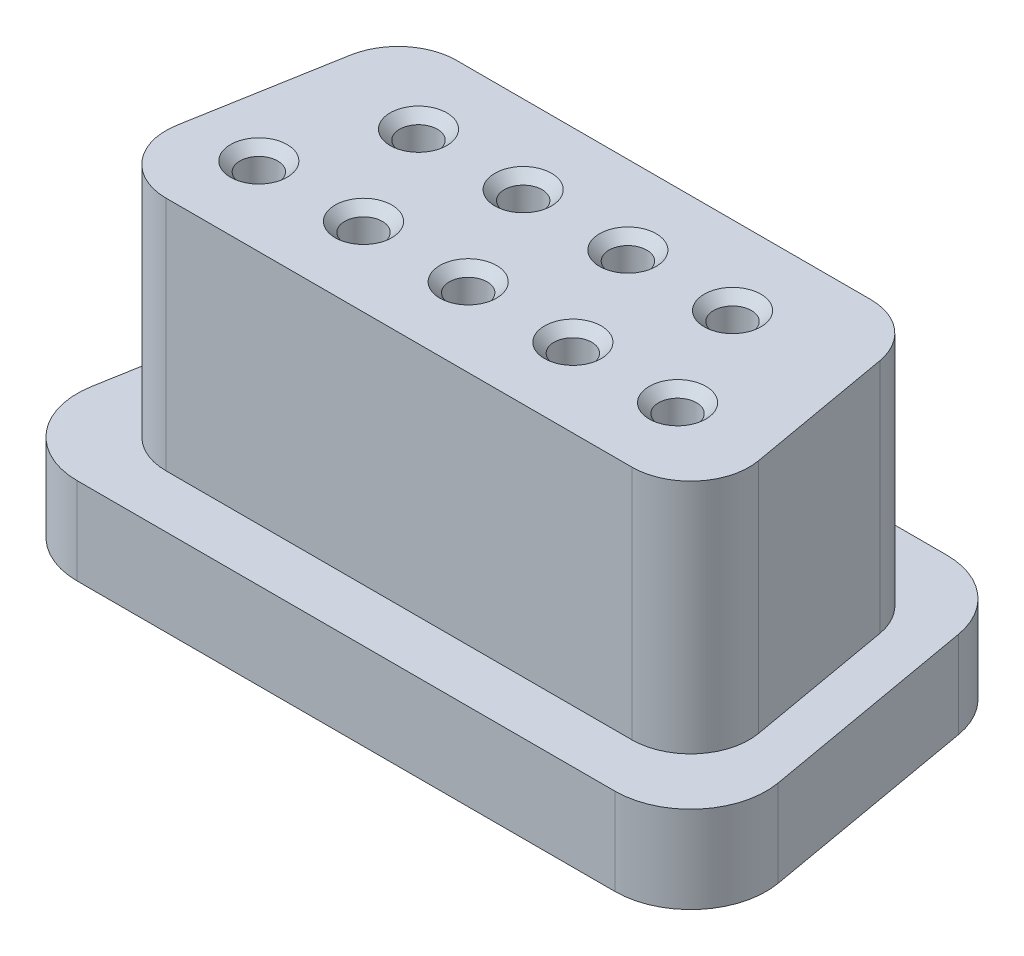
ISO-10303-21;
HEADER;
FILE_DESCRIPTION(('STEP AP214'),'2;1');
FILE_NAME('part.step','',(''),(''),'','','');
FILE_SCHEMA(('AUTOMOTIVE_DESIGN { 1 0 10303 214 1 1 1 1 }'));
ENDSEC;
DATA;
#1=APPLICATION_CONTEXT('core data for automotive mechanical design processes');
#2=APPLICATION_PROTOCOL_DEFINITION('international standard','automotive_design',2000,#1);
#3=PRODUCT_CONTEXT('',#1,'mechanical');
#4=PRODUCT('Part','Part','',(#3));
#5=PRODUCT_RELATED_PRODUCT_CATEGORY('part','',(#4));
#6=PRODUCT_DEFINITION_FORMATION('','',#4);
#7=PRODUCT_DEFINITION_CONTEXT('part definition',#1,'design');
#8=PRODUCT_DEFINITION('design','',#6,#7);
#9=PRODUCT_DEFINITION_SHAPE('','',#8);
#10=(LENGTH_UNIT() NAMED_UNIT(*) SI_UNIT(.MILLI.,.METRE.));
#11=(NAMED_UNIT(*) PLANE_ANGLE_UNIT() SI_UNIT($,.RADIAN.));
#12=(NAMED_UNIT(*) SI_UNIT($,.STERADIAN.) SOLID_ANGLE_UNIT());
#13=UNCERTAINTY_MEASURE_WITH_UNIT(LENGTH_MEASURE(1.E-05),#10,'distance_accuracy_value','');
#14=(GEOMETRIC_REPRESENTATION_CONTEXT(3) GLOBAL_UNCERTAINTY_ASSIGNED_CONTEXT((#13)) GLOBAL_UNIT_ASSIGNED_CONTEXT((#10,
#11,#12)) REPRESENTATION_CONTEXT('',''));
#15=CARTESIAN_POINT('',(0.,0.,0.));
#16=DIRECTION('',(0.,0.,1.));
#17=DIRECTION('',(1.,0.,0.));
#18=AXIS2_PLACEMENT_3D('',#15,#16,#17);
#19=CARTESIAN_POINT('',(-4.405,20.0936464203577,-1.42));
#20=DIRECTION('',(0.,-1.,0.));
#21=DIRECTION('',(0.,0.,-1.));
#22=AXIS2_PLACEMENT_3D('',#19,#20,#21);
#23=CYLINDRICAL_SURFACE('',#22,0.5);
#24=CARTESIAN_POINT('',(-4.405,5.99999999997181,-1.42));
#25=DIRECTION('',(0.,1.,0.));
#26=DIRECTION('',(0.,0.,1.));
#27=AXIS2_PLACEMENT_3D('',#24,#25,#26);
#28=CIRCLE('',#27,0.499999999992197);
#29=CARTESIAN_POINT('',(-4.405,5.99999999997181,-0.920000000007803));
#30=VERTEX_POINT('',#29);
#31=EDGE_CURVE('E201',#30,#30,#28,.T.);
#32=ORIENTED_EDGE('',*,*,#31,.T.);
#33=EDGE_LOOP('',(#32));
#34=FACE_BOUND('',#33,.T.);
#35=CARTESIAN_POINT('',(-4.405,4.7,-1.42));
#36=DIRECTION('',(0.,-1.,0.));
#37=DIRECTION('',(0.,0.,-1.));
#38=AXIS2_PLACEMENT_3D('',#35,#36,#37);
#39=CIRCLE('',#38,0.5);
#40=CARTESIAN_POINT('',(-4.405,4.7,-1.92));
#41=VERTEX_POINT('',#40);
#42=EDGE_CURVE('E20',#41,#41,#39,.T.);
#43=ORIENTED_EDGE('',*,*,#42,.T.);
#44=EDGE_LOOP('',(#43));
#45=FACE_BOUND('',#44,.T.);
#46=ADVANCED_FACE('F16',(#34,#45),#23,.F.);
#47=CARTESIAN_POINT('',(1.135,20.0936464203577,-1.42));
#48=DIRECTION('',(0.,-1.,0.));
#49=DIRECTION('',(0.,0.,-1.));
#50=AXIS2_PLACEMENT_3D('',#47,#48,#49);
#51=CYLINDRICAL_SURFACE('',#50,0.5);
#52=CARTESIAN_POINT('',(1.135,5.99999999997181,-1.42));
#53=DIRECTION('',(0.,1.,0.));
#54=DIRECTION('',(0.,0.,1.));
#55=AXIS2_PLACEMENT_3D('',#52,#53,#54);
#56=CIRCLE('',#55,0.499999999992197);
#57=CARTESIAN_POINT('',(1.135,5.99999999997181,-0.920000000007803));
#58=VERTEX_POINT('',#57);
#59=EDGE_CURVE('E207',#58,#58,#56,.T.);
#60=ORIENTED_EDGE('',*,*,#59,.T.);
#61=EDGE_LOOP('',(#60));
#62=FACE_BOUND('',#61,.T.);
#63=CARTESIAN_POINT('',(1.135,4.7,-1.42));
#64=DIRECTION('',(0.,-1.,0.));
#65=DIRECTION('',(0.,0.,-1.));
#66=AXIS2_PLACEMENT_3D('',#63,#64,#65);
#67=CIRCLE('',#66,0.5);
#68=CARTESIAN_POINT('',(1.135,4.7,-1.92));
#69=VERTEX_POINT('',#68);
#70=EDGE_CURVE('E395',#69,#69,#67,.T.);
#71=ORIENTED_EDGE('',*,*,#70,.T.);
#72=EDGE_LOOP('',(#71));
#73=FACE_BOUND('',#72,.T.);
#74=ADVANCED_FACE('F1050',(#62,#73),#51,.F.);
#75=CARTESIAN_POINT('',(5.29,20.0936464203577,1.42));
#76=DIRECTION('',(0.,-1.,0.));
#77=DIRECTION('',(0.,0.,-1.));
#78=AXIS2_PLACEMENT_3D('',#75,#76,#77);
#79=CYLINDRICAL_SURFACE('',#78,0.5);
#80=CARTESIAN_POINT('',(5.29,5.99999999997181,1.42));
#81=DIRECTION('',(0.,1.,0.));
#82=DIRECTION('',(0.,0.,1.));
#83=AXIS2_PLACEMENT_3D('',#80,#81,#82);
#84=CIRCLE('',#83,0.499999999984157);
#85=CARTESIAN_POINT('',(5.29,5.99999999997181,1.91999999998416));
#86=VERTEX_POINT('',#85);
#87=EDGE_CURVE('E186',#86,#86,#84,.T.);
#88=ORIENTED_EDGE('',*,*,#87,.T.);
#89=EDGE_LOOP('',(#88));
#90=FACE_BOUND('',#89,.T.);
#91=CARTESIAN_POINT('',(5.29,4.7,1.42));
#92=DIRECTION('',(0.,-1.,0.));
#93=DIRECTION('',(0.,0.,-1.));
#94=AXIS2_PLACEMENT_3D('',#91,#92,#93);
#95=CIRCLE('',#94,0.5);
#96=CARTESIAN_POINT('',(5.29,4.7,0.92));
#97=VERTEX_POINT('',#96);
#98=EDGE_CURVE('E393',#97,#97,#95,.T.);
#99=ORIENTED_EDGE('',*,*,#98,.T.);
#100=EDGE_LOOP('',(#99));
#101=FACE_BOUND('',#100,.T.);
#102=ADVANCED_FACE('F1046',(#90,#101),#79,.F.);
#103=CARTESIAN_POINT('',(-0.25,20.0936464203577,1.42));
#104=DIRECTION('',(0.,-1.,0.));
#105=DIRECTION('',(0.,0.,-1.));
#106=AXIS2_PLACEMENT_3D('',#103,#104,#105);
#107=CYLINDRICAL_SURFACE('',#106,0.5);
#108=CARTESIAN_POINT('',(-0.25,5.99999999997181,1.42));
#109=DIRECTION('',(0.,1.,0.));
#110=DIRECTION('',(0.,0.,1.));
#111=AXIS2_PLACEMENT_3D('',#108,#109,#110);
#112=CIRCLE('',#111,0.499999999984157);
#113=CARTESIAN_POINT('',(-0.25,5.99999999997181,1.91999999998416));
#114=VERTEX_POINT('',#113);
#115=EDGE_CURVE('E192',#114,#114,#112,.T.);
#116=ORIENTED_EDGE('',*,*,#115,.T.);
#117=EDGE_LOOP('',(#116));
#118=FACE_BOUND('',#117,.T.);
#119=CARTESIAN_POINT('',(-0.25,4.7,1.42));
#120=DIRECTION('',(0.,-1.,0.));
#121=DIRECTION('',(0.,0.,-1.));
#122=AXIS2_PLACEMENT_3D('',#119,#120,#121);
#123=CIRCLE('',#122,0.5);
#124=CARTESIAN_POINT('',(-0.25,4.7,0.92));
#125=VERTEX_POINT('',#124);
#126=EDGE_CURVE('E390',#125,#125,#123,.T.);
#127=ORIENTED_EDGE('',*,*,#126,.T.);
#128=EDGE_LOOP('',(#127));
#129=FACE_BOUND('',#128,.T.);
#130=ADVANCED_FACE('F1042',(#118,#129),#107,.F.);
#131=CARTESIAN_POINT('',(-3.02,20.0936464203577,1.42));
#132=DIRECTION('',(0.,-1.,0.));
#133=DIRECTION('',(0.,0.,-1.));
#134=AXIS2_PLACEMENT_3D('',#131,#132,#133);
#135=CYLINDRICAL_SURFACE('',#134,0.5);
#136=CARTESIAN_POINT('',(-3.02,5.99999999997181,1.42));
#137=DIRECTION('',(0.,1.,0.));
#138=DIRECTION('',(0.,0.,1.));
#139=AXIS2_PLACEMENT_3D('',#136,#137,#138);
#140=CIRCLE('',#139,0.499999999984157);
#141=CARTESIAN_POINT('',(-3.02,5.99999999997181,1.91999999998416));
#142=VERTEX_POINT('',#141);
#143=EDGE_CURVE('E195',#142,#142,#140,.T.);
#144=ORIENTED_EDGE('',*,*,#143,.T.);
#145=EDGE_LOOP('',(#144));
#146=FACE_BOUND('',#145,.T.);
#147=CARTESIAN_POINT('',(-3.02,4.7,1.42));
#148=DIRECTION('',(0.,-1.,0.));
#149=DIRECTION('',(0.,0.,-1.));
#150=AXIS2_PLACEMENT_3D('',#147,#148,#149);
#151=CIRCLE('',#150,0.5);
#152=CARTESIAN_POINT('',(-3.02,4.7,0.92));
#153=VERTEX_POINT('',#152);
#154=EDGE_CURVE('E387',#153,#153,#151,.T.);
#155=ORIENTED_EDGE('',*,*,#154,.T.);
#156=EDGE_LOOP('',(#155));
#157=FACE_BOUND('',#156,.T.);
#158=ADVANCED_FACE('F1038',(#146,#157),#135,.F.);
#159=CARTESIAN_POINT('',(2.52,20.0936464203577,1.42));
#160=DIRECTION('',(0.,-1.,0.));
#161=DIRECTION('',(0.,0.,-1.));
#162=AXIS2_PLACEMENT_3D('',#159,#160,#161);
#163=CYLINDRICAL_SURFACE('',#162,0.5);
#164=CARTESIAN_POINT('',(2.52,5.99999999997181,1.42));
#165=DIRECTION('',(0.,1.,0.));
#166=DIRECTION('',(0.,0.,1.));
#167=AXIS2_PLACEMENT_3D('',#164,#165,#166);
#168=CIRCLE('',#167,0.499999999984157);
#169=CARTESIAN_POINT('',(2.52,5.99999999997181,1.91999999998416));
#170=VERTEX_POINT('',#169);
#171=EDGE_CURVE('E189',#170,#170,#168,.T.);
#172=ORIENTED_EDGE('',*,*,#171,.T.);
#173=EDGE_LOOP('',(#172));
#174=FACE_BOUND('',#173,.T.);
#175=CARTESIAN_POINT('',(2.52,4.7,1.42));
#176=DIRECTION('',(0.,-1.,0.));
#177=DIRECTION('',(0.,0.,-1.));
#178=AXIS2_PLACEMENT_3D('',#175,#176,#177);
#179=CIRCLE('',#178,0.5);
#180=CARTESIAN_POINT('',(2.52,4.7,0.92));
#181=VERTEX_POINT('',#180);
#182=EDGE_CURVE('E384',#181,#181,#179,.T.);
#183=ORIENTED_EDGE('',*,*,#182,.T.);
#184=EDGE_LOOP('',(#183));
#185=FACE_BOUND('',#184,.T.);
#186=ADVANCED_FACE('F1034',(#174,#185),#163,.F.);
#187=CARTESIAN_POINT('',(3.905,20.0936464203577,-1.42));
#188=DIRECTION('',(0.,-1.,0.));
#189=DIRECTION('',(0.,0.,-1.));
#190=AXIS2_PLACEMENT_3D('',#187,#188,#189);
#191=CYLINDRICAL_SURFACE('',#190,0.5);
#192=CARTESIAN_POINT('',(3.905,5.99999999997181,-1.42));
#193=DIRECTION('',(0.,1.,0.));
#194=DIRECTION('',(0.,0.,1.));
#195=AXIS2_PLACEMENT_3D('',#192,#193,#194);
#196=CIRCLE('',#195,0.499999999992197);
#197=CARTESIAN_POINT('',(3.905,5.99999999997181,-0.920000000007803));
#198=VERTEX_POINT('',#197);
#199=EDGE_CURVE('E210',#198,#198,#196,.T.);
#200=ORIENTED_EDGE('',*,*,#199,.T.);
#201=EDGE_LOOP('',(#200));
#202=FACE_BOUND('',#201,.T.);
#203=CARTESIAN_POINT('',(3.905,4.7,-1.42));
#204=DIRECTION('',(0.,-1.,0.));
#205=DIRECTION('',(0.,0.,-1.));
#206=AXIS2_PLACEMENT_3D('',#203,#204,#205);
#207=CIRCLE('',#206,0.5);
#208=CARTESIAN_POINT('',(3.905,4.7,-1.92));
#209=VERTEX_POINT('',#208);
#210=EDGE_CURVE('E381',#209,#209,#207,.T.);
#211=ORIENTED_EDGE('',*,*,#210,.T.);
#212=EDGE_LOOP('',(#211));
#213=FACE_BOUND('',#212,.T.);
#214=ADVANCED_FACE('F1030',(#202,#213),#191,.F.);
#215=CARTESIAN_POINT('',(-1.635,20.0936464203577,-1.42));
#216=DIRECTION('',(0.,-1.,0.));
#217=DIRECTION('',(0.,0.,-1.));
#218=AXIS2_PLACEMENT_3D('',#215,#216,#217);
#219=CYLINDRICAL_SURFACE('',#218,0.5);
#220=CARTESIAN_POINT('',(-1.635,5.99999999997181,-1.42));
#221=DIRECTION('',(0.,1.,0.));
#222=DIRECTION('',(0.,0.,1.));
#223=AXIS2_PLACEMENT_3D('',#220,#221,#222);
#224=CIRCLE('',#223,0.499999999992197);
#225=CARTESIAN_POINT('',(-1.635,5.99999999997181,-0.920000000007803));
#226=VERTEX_POINT('',#225);
#227=EDGE_CURVE('E204',#226,#226,#224,.T.);
#228=ORIENTED_EDGE('',*,*,#227,.T.);
#229=EDGE_LOOP('',(#228));
#230=FACE_BOUND('',#229,.T.);
#231=CARTESIAN_POINT('',(-1.635,4.7,-1.42));
#232=DIRECTION('',(0.,-1.,0.));
#233=DIRECTION('',(0.,0.,-1.));
#234=AXIS2_PLACEMENT_3D('',#231,#232,#233);
#235=CIRCLE('',#234,0.5);
#236=CARTESIAN_POINT('',(-1.635,4.7,-1.92));
#237=VERTEX_POINT('',#236);
#238=EDGE_CURVE('E378',#237,#237,#235,.T.);
#239=ORIENTED_EDGE('',*,*,#238,.T.);
#240=EDGE_LOOP('',(#239));
#241=FACE_BOUND('',#240,.T.);
#242=ADVANCED_FACE('F1026',(#230,#241),#219,.F.);
#243=CARTESIAN_POINT('',(-5.79,20.0936464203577,1.42));
#244=DIRECTION('',(0.,-1.,0.));
#245=DIRECTION('',(0.,0.,-1.));
#246=AXIS2_PLACEMENT_3D('',#243,#244,#245);
#247=CYLINDRICAL_SURFACE('',#246,0.5);
#248=CARTESIAN_POINT('',(-5.79,5.99999999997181,1.42));
#249=DIRECTION('',(0.,1.,0.));
#250=DIRECTION('',(0.,0.,1.));
#251=AXIS2_PLACEMENT_3D('',#248,#249,#250);
#252=CIRCLE('',#251,0.499999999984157);
#253=CARTESIAN_POINT('',(-5.79,5.99999999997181,1.91999999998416));
#254=VERTEX_POINT('',#253);
#255=EDGE_CURVE('E198',#254,#254,#252,.T.);
#256=ORIENTED_EDGE('',*,*,#255,.T.);
#257=EDGE_LOOP('',(#256));
#258=FACE_BOUND('',#257,.T.);
#259=CARTESIAN_POINT('',(-5.79,4.7,1.42));
#260=DIRECTION('',(0.,-1.,0.));
#261=DIRECTION('',(0.,0.,-1.));
#262=AXIS2_PLACEMENT_3D('',#259,#260,#261);
#263=CIRCLE('',#262,0.5);
#264=CARTESIAN_POINT('',(-5.79,4.7,0.92));
#265=VERTEX_POINT('',#264);
#266=EDGE_CURVE('E375',#265,#265,#263,.T.);
#267=ORIENTED_EDGE('',*,*,#266,.T.);
#268=EDGE_LOOP('',(#267));
#269=FACE_BOUND('',#268,.T.);
#270=ADVANCED_FACE('F1022',(#258,#269),#247,.F.);
#271=CARTESIAN_POINT('',(3.905,6.24999999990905,-1.42));
#272=DIRECTION('',(0.,1.,0.));
#273=DIRECTION('',(0.,0.,1.));
#274=AXIS2_PLACEMENT_3D('',#271,#272,#273);
#275=CONICAL_SURFACE('',#274,0.749999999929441,0.785398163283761);
#276=CARTESIAN_POINT('',(3.905,6.24999999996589,-1.42));
#277=DIRECTION('',(0.,1.,0.));
#278=DIRECTION('',(0.,0.,1.));
#279=AXIS2_PLACEMENT_3D('',#276,#277,#278);
#280=CIRCLE('',#279,0.749999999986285);
#281=CARTESIAN_POINT('',(3.905,6.24999999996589,-0.670000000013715));
#282=VERTEX_POINT('',#281);
#283=EDGE_CURVE('E372',#282,#282,#280,.T.);
#284=ORIENTED_EDGE('',*,*,#283,.T.);
#285=EDGE_LOOP('',(#284));
#286=FACE_BOUND('',#285,.T.);
#287=ORIENTED_EDGE('',*,*,#199,.F.);
#288=EDGE_LOOP('',(#287));
#289=FACE_BOUND('',#288,.T.);
#290=ADVANCED_FACE('F1018',(#286,#289),#275,.F.);
#291=CARTESIAN_POINT('',(1.135,6.24999999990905,-1.42));
#292=DIRECTION('',(0.,1.,0.));
#293=DIRECTION('',(0.,0.,1.));
#294=AXIS2_PLACEMENT_3D('',#291,#292,#293);
#295=CONICAL_SURFACE('',#294,0.749999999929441,0.785398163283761);
#296=CARTESIAN_POINT('',(1.135,6.24999999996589,-1.42));
#297=DIRECTION('',(0.,1.,0.));
#298=DIRECTION('',(0.,0.,1.));
#299=AXIS2_PLACEMENT_3D('',#296,#297,#298);
#300=CIRCLE('',#299,0.749999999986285);
#301=CARTESIAN_POINT('',(1.135,6.24999999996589,-0.670000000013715));
#302=VERTEX_POINT('',#301);
#303=EDGE_CURVE('E369',#302,#302,#300,.T.);
#304=ORIENTED_EDGE('',*,*,#303,.T.);
#305=EDGE_LOOP('',(#304));
#306=FACE_BOUND('',#305,.T.);
#307=ORIENTED_EDGE('',*,*,#59,.F.);
#308=EDGE_LOOP('',(#307));
#309=FACE_BOUND('',#308,.T.);
#310=ADVANCED_FACE('F1014',(#306,#309),#295,.F.);
#311=CARTESIAN_POINT('',(-1.635,6.24999999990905,-1.42));
#312=DIRECTION('',(0.,1.,0.));
#313=DIRECTION('',(0.,0.,1.));
#314=AXIS2_PLACEMENT_3D('',#311,#312,#313);
#315=CONICAL_SURFACE('',#314,0.749999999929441,0.785398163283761);
#316=CARTESIAN_POINT('',(-1.635,6.24999999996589,-1.42));
#317=DIRECTION('',(0.,1.,0.));
#318=DIRECTION('',(0.,0.,1.));
#319=AXIS2_PLACEMENT_3D('',#316,#317,#318);
#320=CIRCLE('',#319,0.749999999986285);
#321=CARTESIAN_POINT('',(-1.635,6.24999999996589,-0.670000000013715));
#322=VERTEX_POINT('',#321);
#323=EDGE_CURVE('E366',#322,#322,#320,.T.);
#324=ORIENTED_EDGE('',*,*,#323,.T.);
#325=EDGE_LOOP('',(#324));
#326=FACE_BOUND('',#325,.T.);
#327=ORIENTED_EDGE('',*,*,#227,.F.);
#328=EDGE_LOOP('',(#327));
#329=FACE_BOUND('',#328,.T.);
#330=ADVANCED_FACE('F1010',(#326,#329),#315,.F.);
#331=CARTESIAN_POINT('',(-4.405,6.24999999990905,-1.42));
#332=DIRECTION('',(0.,1.,0.));
#333=DIRECTION('',(0.,0.,1.));
#334=AXIS2_PLACEMENT_3D('',#331,#332,#333);
#335=CONICAL_SURFACE('',#334,0.749999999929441,0.785398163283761);
#336=CARTESIAN_POINT('',(-4.405,6.24999999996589,-1.42));
#337=DIRECTION('',(0.,1.,0.));
#338=DIRECTION('',(0.,0.,1.));
#339=AXIS2_PLACEMENT_3D('',#336,#337,#338);
#340=CIRCLE('',#339,0.749999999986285);
#341=CARTESIAN_POINT('',(-4.405,6.24999999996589,-0.670000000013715));
#342=VERTEX_POINT('',#341);
#343=EDGE_CURVE('E363',#342,#342,#340,.T.);
#344=ORIENTED_EDGE('',*,*,#343,.T.);
#345=EDGE_LOOP('',(#344));
#346=FACE_BOUND('',#345,.T.);
#347=ORIENTED_EDGE('',*,*,#31,.F.);
#348=EDGE_LOOP('',(#347));
#349=FACE_BOUND('',#348,.T.);
#350=ADVANCED_FACE('F1006',(#346,#349),#335,.F.);
#351=CARTESIAN_POINT('',(-5.79,6.24999999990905,1.42));
#352=DIRECTION('',(0.,1.,0.));
#353=DIRECTION('',(0.,0.,1.));
#354=AXIS2_PLACEMENT_3D('',#351,#352,#353);
#355=CONICAL_SURFACE('',#354,0.749999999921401,0.785398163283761);
#356=CARTESIAN_POINT('',(-5.79,6.24999999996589,1.42));
#357=DIRECTION('',(0.,1.,0.));
#358=DIRECTION('',(0.,0.,1.));
#359=AXIS2_PLACEMENT_3D('',#356,#357,#358);
#360=CIRCLE('',#359,0.749999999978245);
#361=CARTESIAN_POINT('',(-5.79,6.24999999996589,2.16999999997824));
#362=VERTEX_POINT('',#361);
#363=EDGE_CURVE('E360',#362,#362,#360,.T.);
#364=ORIENTED_EDGE('',*,*,#363,.T.);
#365=EDGE_LOOP('',(#364));
#366=FACE_BOUND('',#365,.T.);
#367=ORIENTED_EDGE('',*,*,#255,.F.);
#368=EDGE_LOOP('',(#367));
#369=FACE_BOUND('',#368,.T.);
#370=ADVANCED_FACE('F1002',(#366,#369),#355,.F.);
#371=CARTESIAN_POINT('',(-3.02,6.24999999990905,1.42));
#372=DIRECTION('',(0.,1.,0.));
#373=DIRECTION('',(0.,0.,1.));
#374=AXIS2_PLACEMENT_3D('',#371,#372,#373);
#375=CONICAL_SURFACE('',#374,0.749999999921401,0.785398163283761);
#376=CARTESIAN_POINT('',(-3.02,6.24999999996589,1.42));
#377=DIRECTION('',(0.,1.,0.));
#378=DIRECTION('',(0.,0.,1.));
#379=AXIS2_PLACEMENT_3D('',#376,#377,#378);
#380=CIRCLE('',#379,0.749999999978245);
#381=CARTESIAN_POINT('',(-3.02,6.24999999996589,2.16999999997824));
#382=VERTEX_POINT('',#381);
#383=EDGE_CURVE('E357',#382,#382,#380,.T.);
#384=ORIENTED_EDGE('',*,*,#383,.T.);
#385=EDGE_LOOP('',(#384));
#386=FACE_BOUND('',#385,.T.);
#387=ORIENTED_EDGE('',*,*,#143,.F.);
#388=EDGE_LOOP('',(#387));
#389=FACE_BOUND('',#388,.T.);
#390=ADVANCED_FACE('F998',(#386,#389),#375,.F.);
#391=CARTESIAN_POINT('',(-0.25,6.24999999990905,1.42));
#392=DIRECTION('',(0.,1.,0.));
#393=DIRECTION('',(0.,0.,1.));
#394=AXIS2_PLACEMENT_3D('',#391,#392,#393);
#395=CONICAL_SURFACE('',#394,0.749999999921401,0.785398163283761);
#396=CARTESIAN_POINT('',(-0.25,6.24999999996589,1.42));
#397=DIRECTION('',(0.,1.,0.));
#398=DIRECTION('',(0.,0.,1.));
#399=AXIS2_PLACEMENT_3D('',#396,#397,#398);
#400=CIRCLE('',#399,0.749999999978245);
#401=CARTESIAN_POINT('',(-0.25,6.24999999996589,2.16999999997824));
#402=VERTEX_POINT('',#401);
#403=EDGE_CURVE('E354',#402,#402,#400,.T.);
#404=ORIENTED_EDGE('',*,*,#403,.T.);
#405=EDGE_LOOP('',(#404));
#406=FACE_BOUND('',#405,.T.);
#407=ORIENTED_EDGE('',*,*,#115,.F.);
#408=EDGE_LOOP('',(#407));
#409=FACE_BOUND('',#408,.T.);
#410=ADVANCED_FACE('F994',(#406,#409),#395,.F.);
#411=CARTESIAN_POINT('',(2.52,6.24999999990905,1.42));
#412=DIRECTION('',(0.,1.,0.));
#413=DIRECTION('',(0.,0.,1.));
#414=AXIS2_PLACEMENT_3D('',#411,#412,#413);
#415=CONICAL_SURFACE('',#414,0.749999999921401,0.785398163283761);
#416=CARTESIAN_POINT('',(2.52,6.24999999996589,1.42));
#417=DIRECTION('',(0.,1.,0.));
#418=DIRECTION('',(0.,0.,1.));
#419=AXIS2_PLACEMENT_3D('',#416,#417,#418);
#420=CIRCLE('',#419,0.749999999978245);
#421=CARTESIAN_POINT('',(2.52,6.24999999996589,2.16999999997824));
#422=VERTEX_POINT('',#421);
#423=EDGE_CURVE('E351',#422,#422,#420,.T.);
#424=ORIENTED_EDGE('',*,*,#423,.T.);
#425=EDGE_LOOP('',(#424));
#426=FACE_BOUND('',#425,.T.);
#427=ORIENTED_EDGE('',*,*,#171,.F.);
#428=EDGE_LOOP('',(#427));
#429=FACE_BOUND('',#428,.T.);
#430=ADVANCED_FACE('F990',(#426,#429),#415,.F.);
#431=CARTESIAN_POINT('',(5.29,6.24999999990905,1.42));
#432=DIRECTION('',(0.,1.,0.));
#433=DIRECTION('',(0.,0.,1.));
#434=AXIS2_PLACEMENT_3D('',#431,#432,#433);
#435=CONICAL_SURFACE('',#434,0.749999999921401,0.785398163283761);
#436=CARTESIAN_POINT('',(5.29,6.24999999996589,1.42));
#437=DIRECTION('',(0.,1.,0.));
#438=DIRECTION('',(0.,0.,1.));
#439=AXIS2_PLACEMENT_3D('',#436,#437,#438);
#440=CIRCLE('',#439,0.749999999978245);
#441=CARTESIAN_POINT('',(5.29,6.24999999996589,2.16999999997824));
#442=VERTEX_POINT('',#441);
#443=EDGE_CURVE('E348',#442,#442,#440,.T.);
#444=ORIENTED_EDGE('',*,*,#443,.T.);
#445=EDGE_LOOP('',(#444));
#446=FACE_BOUND('',#445,.T.);
#447=ORIENTED_EDGE('',*,*,#87,.F.);
#448=EDGE_LOOP('',(#447));
#449=FACE_BOUND('',#448,.T.);
#450=ADVANCED_FACE('F407',(#446,#449),#435,.F.);
#451=CARTESIAN_POINT('',(-4.405,4.7,-1.42));
#452=DIRECTION('',(0.,1.,0.));
#453=DIRECTION('',(0.,0.,1.));
#454=AXIS2_PLACEMENT_3D('',#451,#452,#453);
#455=PLANE('',#454);
#456=ORIENTED_EDGE('',*,*,#42,.F.);
#457=EDGE_LOOP('',(#456));
#458=FACE_BOUND('',#457,.T.);
#459=CARTESIAN_POINT('',(-4.405,4.7,-1.42));
#460=DIRECTION('',(0.,-1.,0.));
#461=DIRECTION('',(0.,0.,-1.));
#462=AXIS2_PLACEMENT_3D('',#459,#460,#461);
#463=CIRCLE('',#462,0.75);
#464=CARTESIAN_POINT('',(-4.405,4.7,-2.17));
#465=VERTEX_POINT('',#464);
#466=EDGE_CURVE('E345',#465,#465,#463,.T.);
#467=ORIENTED_EDGE('',*,*,#466,.T.);
#468=EDGE_LOOP('',(#467));
#469=FACE_BOUND('',#468,.T.);
#470=ADVANCED_FACE('F403',(#458,#469),#455,.F.);
#471=CARTESIAN_POINT('',(1.135,4.7,-1.42));
#472=DIRECTION('',(0.,1.,0.));
#473=DIRECTION('',(0.,0.,1.));
#474=AXIS2_PLACEMENT_3D('',#471,#472,#473);
#475=PLANE('',#474);
#476=ORIENTED_EDGE('',*,*,#70,.F.);
#477=EDGE_LOOP('',(#476));
#478=FACE_BOUND('',#477,.T.);
#479=CARTESIAN_POINT('',(1.135,4.7,-1.42));
#480=DIRECTION('',(0.,-1.,0.));
#481=DIRECTION('',(0.,0.,-1.));
#482=AXIS2_PLACEMENT_3D('',#479,#480,#481);
#483=CIRCLE('',#482,0.75);
#484=CARTESIAN_POINT('',(1.135,4.7,-2.17));
#485=VERTEX_POINT('',#484);
#486=EDGE_CURVE('E342',#485,#485,#483,.T.);
#487=ORIENTED_EDGE('',*,*,#486,.T.);
#488=EDGE_LOOP('',(#487));
#489=FACE_BOUND('',#488,.T.);
#490=ADVANCED_FACE('F406',(#478,#489),#475,.F.);
#491=CARTESIAN_POINT('',(5.29,4.7,1.42));
#492=DIRECTION('',(0.,1.,0.));
#493=DIRECTION('',(0.,0.,1.));
#494=AXIS2_PLACEMENT_3D('',#491,#492,#493);
#495=PLANE('',#494);
#496=ORIENTED_EDGE('',*,*,#98,.F.);
#497=EDGE_LOOP('',(#496));
#498=FACE_BOUND('',#497,.T.);
#499=CARTESIAN_POINT('',(5.29,4.7,1.42));
#500=DIRECTION('',(0.,-1.,0.));
#501=DIRECTION('',(0.,0.,-1.));
#502=AXIS2_PLACEMENT_3D('',#499,#500,#501);
#503=CIRCLE('',#502,0.75);
#504=CARTESIAN_POINT('',(5.29,4.7,0.67));
#505=VERTEX_POINT('',#504);
#506=EDGE_CURVE('E339',#505,#505,#503,.T.);
#507=ORIENTED_EDGE('',*,*,#506,.T.);
#508=EDGE_LOOP('',(#507));
#509=FACE_BOUND('',#508,.T.);
#510=ADVANCED_FACE('F971',(#498,#509),#495,.F.);
#511=CARTESIAN_POINT('',(-0.25,4.7,1.42));
#512=DIRECTION('',(0.,1.,0.));
#513=DIRECTION('',(0.,0.,1.));
#514=AXIS2_PLACEMENT_3D('',#511,#512,#513);
#515=PLANE('',#514);
#516=ORIENTED_EDGE('',*,*,#126,.F.);
#517=EDGE_LOOP('',(#516));
#518=FACE_BOUND('',#517,.T.);
#519=CARTESIAN_POINT('',(-0.25,4.7,1.42));
#520=DIRECTION('',(0.,-1.,0.));
#521=DIRECTION('',(0.,0.,-1.));
#522=AXIS2_PLACEMENT_3D('',#519,#520,#521);
#523=CIRCLE('',#522,0.75);
#524=CARTESIAN_POINT('',(-0.25,4.7,0.67));
#525=VERTEX_POINT('',#524);
#526=EDGE_CURVE('E336',#525,#525,#523,.T.);
#527=ORIENTED_EDGE('',*,*,#526,.T.);
#528=EDGE_LOOP('',(#527));
#529=FACE_BOUND('',#528,.T.);
#530=ADVANCED_FACE('F973',(#518,#529),#515,.F.);
#531=CARTESIAN_POINT('',(-3.02,4.7,1.42));
#532=DIRECTION('',(0.,1.,0.));
#533=DIRECTION('',(0.,0.,1.));
#534=AXIS2_PLACEMENT_3D('',#531,#532,#533);
#535=PLANE('',#534);
#536=ORIENTED_EDGE('',*,*,#154,.F.);
#537=EDGE_LOOP('',(#536));
#538=FACE_BOUND('',#537,.T.);
#539=CARTESIAN_POINT('',(-3.02,4.7,1.42));
#540=DIRECTION('',(0.,-1.,0.));
#541=DIRECTION('',(0.,0.,-1.));
#542=AXIS2_PLACEMENT_3D('',#539,#540,#541);
#543=CIRCLE('',#542,0.75);
#544=CARTESIAN_POINT('',(-3.02,4.7,0.67));
#545=VERTEX_POINT('',#544);
#546=EDGE_CURVE('E333',#545,#545,#543,.T.);
#547=ORIENTED_EDGE('',*,*,#546,.T.);
#548=EDGE_LOOP('',(#547));
#549=FACE_BOUND('',#548,.T.);
#550=ADVANCED_FACE('F980',(#538,#549),#535,.F.);
#551=CARTESIAN_POINT('',(2.52,4.7,1.42));
#552=DIRECTION('',(0.,1.,0.));
#553=DIRECTION('',(0.,0.,1.));
#554=AXIS2_PLACEMENT_3D('',#551,#552,#553);
#555=PLANE('',#554);
#556=ORIENTED_EDGE('',*,*,#182,.F.);
#557=EDGE_LOOP('',(#556));
#558=FACE_BOUND('',#557,.T.);
#559=CARTESIAN_POINT('',(2.52,4.7,1.42));
#560=DIRECTION('',(0.,-1.,0.));
#561=DIRECTION('',(0.,0.,-1.));
#562=AXIS2_PLACEMENT_3D('',#559,#560,#561);
#563=CIRCLE('',#562,0.75);
#564=CARTESIAN_POINT('',(2.52,4.7,0.67));
#565=VERTEX_POINT('',#564);
#566=EDGE_CURVE('E330',#565,#565,#563,.T.);
#567=ORIENTED_EDGE('',*,*,#566,.T.);
#568=EDGE_LOOP('',(#567));
#569=FACE_BOUND('',#568,.T.);
#570=ADVANCED_FACE('F1161',(#558,#569),#555,.F.);
#571=CARTESIAN_POINT('',(3.905,4.7,-1.42));
#572=DIRECTION('',(0.,1.,0.));
#573=DIRECTION('',(0.,0.,1.));
#574=AXIS2_PLACEMENT_3D('',#571,#572,#573);
#575=PLANE('',#574);
#576=ORIENTED_EDGE('',*,*,#210,.F.);
#577=EDGE_LOOP('',(#576));
#578=FACE_BOUND('',#577,.T.);
#579=CARTESIAN_POINT('',(3.905,4.7,-1.42));
#580=DIRECTION('',(0.,-1.,0.));
#581=DIRECTION('',(0.,0.,-1.));
#582=AXIS2_PLACEMENT_3D('',#579,#580,#581);
#583=CIRCLE('',#582,0.75);
#584=CARTESIAN_POINT('',(3.905,4.7,-2.17));
#585=VERTEX_POINT('',#584);
#586=EDGE_CURVE('E327',#585,#585,#583,.T.);
#587=ORIENTED_EDGE('',*,*,#586,.T.);
#588=EDGE_LOOP('',(#587));
#589=FACE_BOUND('',#588,.T.);
#590=ADVANCED_FACE('F1170',(#578,#589),#575,.F.);
#591=CARTESIAN_POINT('',(-1.635,4.7,-1.42));
#592=DIRECTION('',(0.,1.,0.));
#593=DIRECTION('',(0.,0.,1.));
#594=AXIS2_PLACEMENT_3D('',#591,#592,#593);
#595=PLANE('',#594);
#596=ORIENTED_EDGE('',*,*,#238,.F.);
#597=EDGE_LOOP('',(#596));
#598=FACE_BOUND('',#597,.T.);
#599=CARTESIAN_POINT('',(-1.635,4.7,-1.42));
#600=DIRECTION('',(0.,-1.,0.));
#601=DIRECTION('',(0.,0.,-1.));
#602=AXIS2_PLACEMENT_3D('',#599,#600,#601);
#603=CIRCLE('',#602,0.75);
#604=CARTESIAN_POINT('',(-1.635,4.7,-2.17));
#605=VERTEX_POINT('',#604);
#606=EDGE_CURVE('E324',#605,#605,#603,.T.);
#607=ORIENTED_EDGE('',*,*,#606,.T.);
#608=EDGE_LOOP('',(#607));
#609=FACE_BOUND('',#608,.T.);
#610=ADVANCED_FACE('F1180',(#598,#609),#595,.F.);
#611=CARTESIAN_POINT('',(-5.79,4.7,1.42));
#612=DIRECTION('',(0.,1.,0.));
#613=DIRECTION('',(0.,0.,1.));
#614=AXIS2_PLACEMENT_3D('',#611,#612,#613);
#615=PLANE('',#614);
#616=ORIENTED_EDGE('',*,*,#266,.F.);
#617=EDGE_LOOP('',(#616));
#618=FACE_BOUND('',#617,.T.);
#619=CARTESIAN_POINT('',(-5.79,4.7,1.42));
#620=DIRECTION('',(0.,-1.,0.));
#621=DIRECTION('',(0.,0.,-1.));
#622=AXIS2_PLACEMENT_3D('',#619,#620,#621);
#623=CIRCLE('',#622,0.75);
#624=CARTESIAN_POINT('',(-5.79,4.7,0.67));
#625=VERTEX_POINT('',#624);
#626=EDGE_CURVE('E149',#625,#625,#623,.T.);
#627=ORIENTED_EDGE('',*,*,#626,.T.);
#628=EDGE_LOOP('',(#627));
#629=FACE_BOUND('',#628,.T.);
#630=ADVANCED_FACE('F424',(#618,#629),#615,.F.);
#631=CARTESIAN_POINT('',(6.165,6.25,1.95000000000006));
#632=DIRECTION('',(0.,-1.,0.));
#633=DIRECTION('',(0.,0.,-1.));
#634=AXIS2_PLACEMENT_3D('',#631,#632,#633);
#635=PLANE('',#634);
#636=ORIENTED_EDGE('',*,*,#443,.F.);
#637=EDGE_LOOP('',(#636));
#638=FACE_BOUND('',#637,.T.);
#639=ORIENTED_EDGE('',*,*,#423,.F.);
#640=EDGE_LOOP('',(#639));
#641=FACE_BOUND('',#640,.T.);
#642=ORIENTED_EDGE('',*,*,#403,.F.);
#643=EDGE_LOOP('',(#642));
#644=FACE_BOUND('',#643,.T.);
#645=ORIENTED_EDGE('',*,*,#383,.F.);
#646=EDGE_LOOP('',(#645));
#647=FACE_BOUND('',#646,.T.);
#648=ORIENTED_EDGE('',*,*,#363,.F.);
#649=EDGE_LOOP('',(#648));
#650=FACE_BOUND('',#649,.T.);
#651=ORIENTED_EDGE('',*,*,#343,.F.);
#652=EDGE_LOOP('',(#651));
#653=FACE_BOUND('',#652,.T.);
#654=ORIENTED_EDGE('',*,*,#323,.F.);
#655=EDGE_LOOP('',(#654));
#656=FACE_BOUND('',#655,.T.);
#657=ORIENTED_EDGE('',*,*,#303,.F.);
#658=EDGE_LOOP('',(#657));
#659=FACE_BOUND('',#658,.T.);
#660=ORIENTED_EDGE('',*,*,#283,.F.);
#661=EDGE_LOOP('',(#660));
#662=FACE_BOUND('',#661,.T.);
#663=DIRECTION('',(-0.173648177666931,0.,-0.984807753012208));
#664=VECTOR('',#663,1.);
#665=CARTESIAN_POINT('',(7.00377679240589,6.25,-2.21915467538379));
#666=LINE('',#665,#664);
#667=CARTESIAN_POINT('',(7.00377679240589,6.25,-2.21915467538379));
#668=VERTEX_POINT('',#667);
#669=CARTESIAN_POINT('',(7.69145201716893,6.25,1.68084532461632));
#670=VERTEX_POINT('',#669);
#671=EDGE_CURVE('E127',#668,#670,#666,.F.);
#672=ORIENTED_EDGE('',*,*,#671,.F.);
#673=CARTESIAN_POINT('',(5.47732477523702,6.25,-1.95000000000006));
#674=DIRECTION('',(0.,-1.,0.));
#675=DIRECTION('',(0.,0.,-1.));
#676=AXIS2_PLACEMENT_3D('',#673,#674,#675);
#677=CIRCLE('',#676,1.54999999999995);
#678=CARTESIAN_POINT('',(5.47732477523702,6.25,-3.5));
#679=VERTEX_POINT('',#678);
#680=EDGE_CURVE('E165',#679,#668,#677,.T.);
#681=ORIENTED_EDGE('',*,*,#680,.F.);
#682=DIRECTION('',(-1.,0.,0.));
#683=VECTOR('',#682,1.);
#684=CARTESIAN_POINT('',(-5.47732477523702,6.25,-3.5));
#685=LINE('',#684,#683);
#686=CARTESIAN_POINT('',(-5.47732477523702,6.25,-3.5));
#687=VERTEX_POINT('',#686);
#688=EDGE_CURVE('E166',#687,#679,#685,.F.);
#689=ORIENTED_EDGE('',*,*,#688,.F.);
#690=CARTESIAN_POINT('',(-5.47732477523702,6.25,-1.95000000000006));
#691=DIRECTION('',(0.,-1.,0.));
#692=DIRECTION('',(0.,0.,-1.));
#693=AXIS2_PLACEMENT_3D('',#690,#691,#692);
#694=CIRCLE('',#693,1.54999999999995);
#695=CARTESIAN_POINT('',(-7.00377679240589,6.25,-2.21915467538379));
#696=VERTEX_POINT('',#695);
#697=EDGE_CURVE('E170',#696,#687,#694,.T.);
#698=ORIENTED_EDGE('',*,*,#697,.F.);
#699=DIRECTION('',(-0.173648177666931,0.,0.984807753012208));
#700=VECTOR('',#699,1.);
#701=CARTESIAN_POINT('',(-7.69145201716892,6.25,1.68084532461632));
#702=LINE('',#701,#700);
#703=CARTESIAN_POINT('',(-7.69145201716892,6.25,1.68084532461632));
#704=VERTEX_POINT('',#703);
#705=EDGE_CURVE('E174',#704,#696,#702,.F.);
#706=ORIENTED_EDGE('',*,*,#705,.F.);
#707=CARTESIAN_POINT('',(-6.165,6.25,1.95000000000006));
#708=DIRECTION('',(0.,-1.,0.));
#709=DIRECTION('',(0.,0.,-1.));
#710=AXIS2_PLACEMENT_3D('',#707,#708,#709);
#711=CIRCLE('',#710,1.54999999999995);
#712=CARTESIAN_POINT('',(-6.165,6.25,3.5));
#713=VERTEX_POINT('',#712);
#714=EDGE_CURVE('E178',#713,#704,#711,.T.);
#715=ORIENTED_EDGE('',*,*,#714,.F.);
#716=DIRECTION('',(1.,0.,0.));
#717=VECTOR('',#716,1.);
#718=CARTESIAN_POINT('',(6.165,6.25,3.5));
#719=LINE('',#718,#717);
#720=CARTESIAN_POINT('',(6.165,6.25,3.5));
#721=VERTEX_POINT('',#720);
#722=EDGE_CURVE('E144',#721,#713,#719,.F.);
#723=ORIENTED_EDGE('',*,*,#722,.F.);
#724=CARTESIAN_POINT('',(6.165,6.25,1.95000000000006));
#725=DIRECTION('',(0.,-1.,0.));
#726=DIRECTION('',(0.,0.,-1.));
#727=AXIS2_PLACEMENT_3D('',#724,#725,#726);
#728=CIRCLE('',#727,1.54999999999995);
#729=EDGE_CURVE('E141',#670,#721,#728,.T.);
#730=ORIENTED_EDGE('',*,*,#729,.F.);
#731=EDGE_LOOP('',(#672,#681,#689,#698,#706,#715,#723,#730));
#732=FACE_BOUND('',#731,.T.);
#733=ADVANCED_FACE('F142',(#638,#641,#644,#647,#650,#653,#656,#659,#662,#732),#635,.F.);
#734=CARTESIAN_POINT('',(-4.405,4.7,-1.42));
#735=DIRECTION('',(0.,-1.,0.));
#736=DIRECTION('',(0.,0.,-1.));
#737=AXIS2_PLACEMENT_3D('',#734,#735,#736);
#738=CYLINDRICAL_SURFACE('',#737,0.75);
#739=CARTESIAN_POINT('',(-4.405,0.075,-1.42));
#740=DIRECTION('',(0.,1.,0.));
#741=DIRECTION('',(0.,0.,1.));
#742=AXIS2_PLACEMENT_3D('',#739,#740,#741);
#743=CIRCLE('',#742,0.75);
#744=CARTESIAN_POINT('',(-4.405,0.075,-0.67));
#745=VERTEX_POINT('',#744);
#746=EDGE_CURVE('E154',#745,#745,#743,.T.);
#747=ORIENTED_EDGE('',*,*,#746,.F.);
#748=EDGE_LOOP('',(#747));
#749=FACE_BOUND('',#748,.T.);
#750=ORIENTED_EDGE('',*,*,#466,.F.);
#751=EDGE_LOOP('',(#750));
#752=FACE_BOUND('',#751,.T.);
#753=ADVANCED_FACE('F411',(#749,#752),#738,.F.);
#754=CARTESIAN_POINT('',(1.135,4.7,-1.42));
#755=DIRECTION('',(0.,-1.,0.));
#756=DIRECTION('',(0.,0.,-1.));
#757=AXIS2_PLACEMENT_3D('',#754,#755,#756);
#758=CYLINDRICAL_SURFACE('',#757,0.75);
#759=CARTESIAN_POINT('',(1.135,0.075,-1.42));
#760=DIRECTION('',(0.,1.,0.));
#761=DIRECTION('',(0.,0.,1.));
#762=AXIS2_PLACEMENT_3D('',#759,#760,#761);
#763=CIRCLE('',#762,0.75);
#764=CARTESIAN_POINT('',(1.135,0.075,-0.67));
#765=VERTEX_POINT('',#764);
#766=EDGE_CURVE('E157',#765,#765,#763,.T.);
#767=ORIENTED_EDGE('',*,*,#766,.F.);
#768=EDGE_LOOP('',(#767));
#769=FACE_BOUND('',#768,.T.);
#770=ORIENTED_EDGE('',*,*,#486,.F.);
#771=EDGE_LOOP('',(#770));
#772=FACE_BOUND('',#771,.T.);
#773=ADVANCED_FACE('F413',(#769,#772),#758,.F.);
#774=CARTESIAN_POINT('',(5.29,4.7,1.42));
#775=DIRECTION('',(0.,-1.,0.));
#776=DIRECTION('',(0.,0.,-1.));
#777=AXIS2_PLACEMENT_3D('',#774,#775,#776);
#778=CYLINDRICAL_SURFACE('',#777,0.75);
#779=CARTESIAN_POINT('',(5.29,0.075,1.42));
#780=DIRECTION('',(0.,1.,0.));
#781=DIRECTION('',(0.,0.,1.));
#782=AXIS2_PLACEMENT_3D('',#779,#780,#781);
#783=CIRCLE('',#782,0.75);
#784=CARTESIAN_POINT('',(5.29,0.075,2.17));
#785=VERTEX_POINT('',#784);
#786=EDGE_CURVE('E770',#785,#785,#783,.T.);
#787=ORIENTED_EDGE('',*,*,#786,.F.);
#788=EDGE_LOOP('',(#787));
#789=FACE_BOUND('',#788,.T.);
#790=ORIENTED_EDGE('',*,*,#506,.F.);
#791=EDGE_LOOP('',(#790));
#792=FACE_BOUND('',#791,.T.);
#793=ADVANCED_FACE('F421',(#789,#792),#778,.F.);
#794=CARTESIAN_POINT('',(-0.25,4.7,1.42));
#795=DIRECTION('',(0.,-1.,0.));
#796=DIRECTION('',(0.,0.,-1.));
#797=AXIS2_PLACEMENT_3D('',#794,#795,#796);
#798=CYLINDRICAL_SURFACE('',#797,0.75);
#799=CARTESIAN_POINT('',(-0.25,0.075,1.42));
#800=DIRECTION('',(0.,1.,0.));
#801=DIRECTION('',(0.,0.,1.));
#802=AXIS2_PLACEMENT_3D('',#799,#800,#801);
#803=CIRCLE('',#802,0.75);
#804=CARTESIAN_POINT('',(-0.25,0.075,2.17));
#805=VERTEX_POINT('',#804);
#806=EDGE_CURVE('E767',#805,#805,#803,.T.);
#807=ORIENTED_EDGE('',*,*,#806,.F.);
#808=EDGE_LOOP('',(#807));
#809=FACE_BOUND('',#808,.T.);
#810=ORIENTED_EDGE('',*,*,#526,.F.);
#811=EDGE_LOOP('',(#810));
#812=FACE_BOUND('',#811,.T.);
#813=ADVANCED_FACE('F957',(#809,#812),#798,.F.);
#814=CARTESIAN_POINT('',(-3.02,4.7,1.42));
#815=DIRECTION('',(0.,-1.,0.));
#816=DIRECTION('',(0.,0.,-1.));
#817=AXIS2_PLACEMENT_3D('',#814,#815,#816);
#818=CYLINDRICAL_SURFACE('',#817,0.75);
#819=CARTESIAN_POINT('',(-3.02,0.075,1.42));
#820=DIRECTION('',(0.,1.,0.));
#821=DIRECTION('',(0.,0.,1.));
#822=AXIS2_PLACEMENT_3D('',#819,#820,#821);
#823=CIRCLE('',#822,0.75);
#824=CARTESIAN_POINT('',(-3.02,0.075,2.17));
#825=VERTEX_POINT('',#824);
#826=EDGE_CURVE('E732',#825,#825,#823,.T.);
#827=ORIENTED_EDGE('',*,*,#826,.F.);
#828=EDGE_LOOP('',(#827));
#829=FACE_BOUND('',#828,.T.);
#830=ORIENTED_EDGE('',*,*,#546,.F.);
#831=EDGE_LOOP('',(#830));
#832=FACE_BOUND('',#831,.T.);
#833=ADVANCED_FACE('F953',(#829,#832),#818,.F.);
#834=CARTESIAN_POINT('',(2.52,4.7,1.42));
#835=DIRECTION('',(0.,-1.,0.));
#836=DIRECTION('',(0.,0.,-1.));
#837=AXIS2_PLACEMENT_3D('',#834,#835,#836);
#838=CYLINDRICAL_SURFACE('',#837,0.75);
#839=CARTESIAN_POINT('',(2.52,0.075,1.42));
#840=DIRECTION('',(0.,1.,0.));
#841=DIRECTION('',(0.,0.,1.));
#842=AXIS2_PLACEMENT_3D('',#839,#840,#841);
#843=CIRCLE('',#842,0.75);
#844=CARTESIAN_POINT('',(2.52,0.075,2.17));
#845=VERTEX_POINT('',#844);
#846=EDGE_CURVE('E729',#845,#845,#843,.T.);
#847=ORIENTED_EDGE('',*,*,#846,.F.);
#848=EDGE_LOOP('',(#847));
#849=FACE_BOUND('',#848,.T.);
#850=ORIENTED_EDGE('',*,*,#566,.F.);
#851=EDGE_LOOP('',(#850));
#852=FACE_BOUND('',#851,.T.);
#853=ADVANCED_FACE('F949',(#849,#852),#838,.F.);
#854=CARTESIAN_POINT('',(3.905,4.7,-1.42));
#855=DIRECTION('',(0.,-1.,0.));
#856=DIRECTION('',(0.,0.,-1.));
#857=AXIS2_PLACEMENT_3D('',#854,#855,#856);
#858=CYLINDRICAL_SURFACE('',#857,0.75);
#859=CARTESIAN_POINT('',(3.905,0.075,-1.42));
#860=DIRECTION('',(0.,1.,0.));
#861=DIRECTION('',(0.,0.,1.));
#862=AXIS2_PLACEMENT_3D('',#859,#860,#861);
#863=CIRCLE('',#862,0.75);
#864=CARTESIAN_POINT('',(3.905,0.075,-0.67));
#865=VERTEX_POINT('',#864);
#866=EDGE_CURVE('E696',#865,#865,#863,.T.);
#867=ORIENTED_EDGE('',*,*,#866,.F.);
#868=EDGE_LOOP('',(#867));
#869=FACE_BOUND('',#868,.T.);
#870=ORIENTED_EDGE('',*,*,#586,.F.);
#871=EDGE_LOOP('',(#870));
#872=FACE_BOUND('',#871,.T.);
#873=ADVANCED_FACE('F945',(#869,#872),#858,.F.);
#874=CARTESIAN_POINT('',(-1.635,4.7,-1.42));
#875=DIRECTION('',(0.,-1.,0.));
#876=DIRECTION('',(0.,0.,-1.));
#877=AXIS2_PLACEMENT_3D('',#874,#875,#876);
#878=CYLINDRICAL_SURFACE('',#877,0.75);
#879=CARTESIAN_POINT('',(-1.635,0.075,-1.42));
#880=DIRECTION('',(0.,1.,0.));
#881=DIRECTION('',(0.,0.,1.));
#882=AXIS2_PLACEMENT_3D('',#879,#880,#881);
#883=CIRCLE('',#882,0.75);
#884=CARTESIAN_POINT('',(-1.635,0.075,-0.67));
#885=VERTEX_POINT('',#884);
#886=EDGE_CURVE('E681',#885,#885,#883,.T.);
#887=ORIENTED_EDGE('',*,*,#886,.F.);
#888=EDGE_LOOP('',(#887));
#889=FACE_BOUND('',#888,.T.);
#890=ORIENTED_EDGE('',*,*,#606,.F.);
#891=EDGE_LOOP('',(#890));
#892=FACE_BOUND('',#891,.T.);
#893=ADVANCED_FACE('F941',(#889,#892),#878,.F.);
#894=CARTESIAN_POINT('',(-5.79,4.7,1.42));
#895=DIRECTION('',(0.,-1.,0.));
#896=DIRECTION('',(0.,0.,-1.));
#897=AXIS2_PLACEMENT_3D('',#894,#895,#896);
#898=CYLINDRICAL_SURFACE('',#897,0.75);
#899=CARTESIAN_POINT('',(-5.79,0.075,1.42));
#900=DIRECTION('',(0.,1.,0.));
#901=DIRECTION('',(0.,0.,1.));
#902=AXIS2_PLACEMENT_3D('',#899,#900,#901);
#903=CIRCLE('',#902,0.75);
#904=CARTESIAN_POINT('',(-5.79,0.075,2.17));
#905=VERTEX_POINT('',#904);
#906=EDGE_CURVE('E318',#905,#905,#903,.T.);
#907=ORIENTED_EDGE('',*,*,#906,.F.);
#908=EDGE_LOOP('',(#907));
#909=FACE_BOUND('',#908,.T.);
#910=ORIENTED_EDGE('',*,*,#626,.F.);
#911=EDGE_LOOP('',(#910));
#912=FACE_BOUND('',#911,.T.);
#913=ADVANCED_FACE('F938',(#909,#912),#898,.F.);
#914=CARTESIAN_POINT('',(6.165,6.25,1.95000000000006));
#915=DIRECTION('',(0.,-1.,0.));
#916=DIRECTION('',(0.,0.,-1.));
#917=AXIS2_PLACEMENT_3D('',#914,#915,#916);
#918=CYLINDRICAL_SURFACE('',#917,1.54999999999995);
#919=ORIENTED_EDGE('',*,*,#729,.T.);
#920=DIRECTION('',(0.,1.,0.));
#921=VECTOR('',#920,1.);
#922=CARTESIAN_POINT('',(6.165,6.25,3.5));
#923=LINE('',#922,#921);
#924=CARTESIAN_POINT('',(6.165,0.,3.5));
#925=VERTEX_POINT('',#924);
#926=EDGE_CURVE('E148',#925,#721,#923,.T.);
#927=ORIENTED_EDGE('',*,*,#926,.F.);
#928=CARTESIAN_POINT('',(6.165,0.,1.95000000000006));
#929=DIRECTION('',(0.,-1.,0.));
#930=DIRECTION('',(0.,0.,-1.));
#931=AXIS2_PLACEMENT_3D('',#928,#929,#930);
#932=CIRCLE('',#931,1.54999999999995);
#933=CARTESIAN_POINT('',(7.69145201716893,0.,1.68084532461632));
#934=VERTEX_POINT('',#933);
#935=EDGE_CURVE('E153',#934,#925,#932,.T.);
#936=ORIENTED_EDGE('',*,*,#935,.F.);
#937=DIRECTION('',(0.,1.,0.));
#938=VECTOR('',#937,1.);
#939=CARTESIAN_POINT('',(7.69145201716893,6.25,1.68084532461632));
#940=LINE('',#939,#938);
#941=EDGE_CURVE('E132',#670,#934,#940,.F.);
#942=ORIENTED_EDGE('',*,*,#941,.F.);
#943=EDGE_LOOP('',(#919,#927,#936,#942));
#944=FACE_BOUND('',#943,.T.);
#945=ADVANCED_FACE('F152',(#944),#918,.T.);
#946=CARTESIAN_POINT('',(6.165,6.25,3.5));
#947=DIRECTION('',(0.,0.,1.));
#948=DIRECTION('',(1.,0.,0.));
#949=AXIS2_PLACEMENT_3D('',#946,#947,#948);
#950=PLANE('',#949);
#951=ORIENTED_EDGE('',*,*,#722,.T.);
#952=DIRECTION('',(0.,-1.,0.));
#953=VECTOR('',#952,1.);
#954=CARTESIAN_POINT('',(-6.165,6.25,3.50000000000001));
#955=LINE('',#954,#953);
#956=CARTESIAN_POINT('',(-6.165,0.,3.5));
#957=VERTEX_POINT('',#956);
#958=EDGE_CURVE('E179',#957,#713,#955,.F.);
#959=ORIENTED_EDGE('',*,*,#958,.F.);
#960=DIRECTION('',(1.,0.,0.));
#961=VECTOR('',#960,1.);
#962=CARTESIAN_POINT('',(-7.115,0.,3.5));
#963=LINE('',#962,#961);
#964=EDGE_CURVE('E316',#925,#957,#963,.F.);
#965=ORIENTED_EDGE('',*,*,#964,.F.);
#966=ORIENTED_EDGE('',*,*,#926,.T.);
#967=EDGE_LOOP('',(#951,#959,#965,#966));
#968=FACE_BOUND('',#967,.T.);
#969=ADVANCED_FACE('F931',(#968),#950,.T.);
#970=CARTESIAN_POINT('',(-6.165,6.25,1.95000000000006));
#971=DIRECTION('',(0.,-1.,0.));
#972=DIRECTION('',(0.,0.,-1.));
#973=AXIS2_PLACEMENT_3D('',#970,#971,#972);
#974=CYLINDRICAL_SURFACE('',#973,1.54999999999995);
#975=ORIENTED_EDGE('',*,*,#714,.T.);
#976=DIRECTION('',(0.,1.,0.));
#977=VECTOR('',#976,1.);
#978=CARTESIAN_POINT('',(-7.69145201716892,6.25,1.68084532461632));
#979=LINE('',#978,#977);
#980=CARTESIAN_POINT('',(-7.69145201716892,0.,1.68084532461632));
#981=VERTEX_POINT('',#980);
#982=EDGE_CURVE('E175',#981,#704,#979,.T.);
#983=ORIENTED_EDGE('',*,*,#982,.F.);
#984=CARTESIAN_POINT('',(-6.165,0.,1.95000000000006));
#985=DIRECTION('',(0.,-1.,0.));
#986=DIRECTION('',(0.,0.,-1.));
#987=AXIS2_PLACEMENT_3D('',#984,#985,#986);
#988=CIRCLE('',#987,1.54999999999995);
#989=EDGE_CURVE('E314',#957,#981,#988,.T.);
#990=ORIENTED_EDGE('',*,*,#989,.F.);
#991=ORIENTED_EDGE('',*,*,#958,.T.);
#992=EDGE_LOOP('',(#975,#983,#990,#991));
#993=FACE_BOUND('',#992,.T.);
#994=ADVANCED_FACE('F927',(#993),#974,.T.);
#995=CARTESIAN_POINT('',(-7.69145201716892,6.25,1.68084532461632));
#996=DIRECTION('',(-0.984807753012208,0.,-0.173648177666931));
#997=DIRECTION('',(-0.173648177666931,0.,0.984807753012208));
#998=AXIS2_PLACEMENT_3D('',#995,#996,#997);
#999=PLANE('',#998);
#1000=ORIENTED_EDGE('',*,*,#705,.T.);
#1001=DIRECTION('',(0.,-1.,0.));
#1002=VECTOR('',#1001,1.);
#1003=CARTESIAN_POINT('',(-7.00377679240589,6.25,-2.21915467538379));
#1004=LINE('',#1003,#1002);
#1005=CARTESIAN_POINT('',(-7.00377679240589,0.,-2.21915467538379));
#1006=VERTEX_POINT('',#1005);
#1007=EDGE_CURVE('E171',#1006,#696,#1004,.F.);
#1008=ORIENTED_EDGE('',*,*,#1007,.F.);
#1009=DIRECTION('',(0.17364817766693,0.,-0.984807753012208));
#1010=VECTOR('',#1009,1.);
#1011=CARTESIAN_POINT('',(-7.69145201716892,0.,1.68084532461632));
#1012=LINE('',#1011,#1010);
#1013=EDGE_CURVE('E313',#981,#1006,#1012,.T.);
#1014=ORIENTED_EDGE('',*,*,#1013,.F.);
#1015=ORIENTED_EDGE('',*,*,#982,.T.);
#1016=EDGE_LOOP('',(#1000,#1008,#1014,#1015));
#1017=FACE_BOUND('',#1016,.T.);
#1018=ADVANCED_FACE('F923',(#1017),#999,.T.);
#1019=CARTESIAN_POINT('',(-5.47732477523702,6.25,-1.95000000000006));
#1020=DIRECTION('',(0.,-1.,0.));
#1021=DIRECTION('',(0.,0.,-1.));
#1022=AXIS2_PLACEMENT_3D('',#1019,#1020,#1021);
#1023=CYLINDRICAL_SURFACE('',#1022,1.54999999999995);
#1024=ORIENTED_EDGE('',*,*,#697,.T.);
#1025=DIRECTION('',(0.,1.,0.));
#1026=VECTOR('',#1025,1.);
#1027=CARTESIAN_POINT('',(-5.47732477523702,6.25,-3.5));
#1028=LINE('',#1027,#1026);
#1029=CARTESIAN_POINT('',(-5.47732477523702,0.,-3.5));
#1030=VERTEX_POINT('',#1029);
#1031=EDGE_CURVE('E167',#1030,#687,#1028,.T.);
#1032=ORIENTED_EDGE('',*,*,#1031,.F.);
#1033=CARTESIAN_POINT('',(-5.47732477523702,0.,-1.95000000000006));
#1034=DIRECTION('',(0.,-1.,0.));
#1035=DIRECTION('',(0.,0.,-1.));
#1036=AXIS2_PLACEMENT_3D('',#1033,#1034,#1035);
#1037=CIRCLE('',#1036,1.54999999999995);
#1038=EDGE_CURVE('E311',#1006,#1030,#1037,.T.);
#1039=ORIENTED_EDGE('',*,*,#1038,.F.);
#1040=ORIENTED_EDGE('',*,*,#1007,.T.);
#1041=EDGE_LOOP('',(#1024,#1032,#1039,#1040));
#1042=FACE_BOUND('',#1041,.T.);
#1043=ADVANCED_FACE('F919',(#1042),#1023,.T.);
#1044=CARTESIAN_POINT('',(-5.47732477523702,6.25,-3.5));
#1045=DIRECTION('',(0.,0.,-1.));
#1046=DIRECTION('',(-1.,0.,0.));
#1047=AXIS2_PLACEMENT_3D('',#1044,#1045,#1046);
#1048=PLANE('',#1047);
#1049=ORIENTED_EDGE('',*,*,#688,.T.);
#1050=DIRECTION('',(0.,-1.,0.));
#1051=VECTOR('',#1050,1.);
#1052=CARTESIAN_POINT('',(5.47732477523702,6.25,-3.50000000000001));
#1053=LINE('',#1052,#1051);
#1054=CARTESIAN_POINT('',(5.47732477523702,0.,-3.5));
#1055=VERTEX_POINT('',#1054);
#1056=EDGE_CURVE('E162',#1055,#679,#1053,.F.);
#1057=ORIENTED_EDGE('',*,*,#1056,.F.);
#1058=DIRECTION('',(1.,0.,0.));
#1059=VECTOR('',#1058,1.);
#1060=CARTESIAN_POINT('',(-7.115,0.,-3.5));
#1061=LINE('',#1060,#1059);
#1062=EDGE_CURVE('E310',#1030,#1055,#1061,.T.);
#1063=ORIENTED_EDGE('',*,*,#1062,.F.);
#1064=ORIENTED_EDGE('',*,*,#1031,.T.);
#1065=EDGE_LOOP('',(#1049,#1057,#1063,#1064));
#1066=FACE_BOUND('',#1065,.T.);
#1067=ADVANCED_FACE('F915',(#1066),#1048,.T.);
#1068=CARTESIAN_POINT('',(5.47732477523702,6.25,-1.95000000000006));
#1069=DIRECTION('',(0.,-1.,0.));
#1070=DIRECTION('',(0.,0.,-1.));
#1071=AXIS2_PLACEMENT_3D('',#1068,#1069,#1070);
#1072=CYLINDRICAL_SURFACE('',#1071,1.54999999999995);
#1073=ORIENTED_EDGE('',*,*,#680,.T.);
#1074=DIRECTION('',(0.,1.,0.));
#1075=VECTOR('',#1074,1.);
#1076=CARTESIAN_POINT('',(7.00377679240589,6.25,-2.21915467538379));
#1077=LINE('',#1076,#1075);
#1078=CARTESIAN_POINT('',(7.00377679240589,0.,-2.21915467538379));
#1079=VERTEX_POINT('',#1078);
#1080=EDGE_CURVE('E135',#1079,#668,#1077,.T.);
#1081=ORIENTED_EDGE('',*,*,#1080,.F.);
#1082=CARTESIAN_POINT('',(5.47732477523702,0.,-1.95000000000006));
#1083=DIRECTION('',(0.,-1.,0.));
#1084=DIRECTION('',(0.,0.,-1.));
#1085=AXIS2_PLACEMENT_3D('',#1082,#1083,#1084);
#1086=CIRCLE('',#1085,1.54999999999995);
#1087=EDGE_CURVE('E308',#1055,#1079,#1086,.T.);
#1088=ORIENTED_EDGE('',*,*,#1087,.F.);
#1089=ORIENTED_EDGE('',*,*,#1056,.T.);
#1090=EDGE_LOOP('',(#1073,#1081,#1088,#1089));
#1091=FACE_BOUND('',#1090,.T.);
#1092=ADVANCED_FACE('F909',(#1091),#1072,.T.);
#1093=CARTESIAN_POINT('',(7.00377679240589,6.25,-2.21915467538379));
#1094=DIRECTION('',(0.984807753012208,0.,-0.173648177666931));
#1095=DIRECTION('',(-0.173648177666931,0.,-0.984807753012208));
#1096=AXIS2_PLACEMENT_3D('',#1093,#1094,#1095);
#1097=PLANE('',#1096);
#1098=ORIENTED_EDGE('',*,*,#671,.T.);
#1099=ORIENTED_EDGE('',*,*,#941,.T.);
#1100=DIRECTION('',(0.173648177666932,0.,0.984807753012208));
#1101=VECTOR('',#1100,1.);
#1102=CARTESIAN_POINT('',(7.00377679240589,0.,-2.21915467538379));
#1103=LINE('',#1102,#1101);
#1104=EDGE_CURVE('E307',#1079,#934,#1103,.T.);
#1105=ORIENTED_EDGE('',*,*,#1104,.F.);
#1106=ORIENTED_EDGE('',*,*,#1080,.T.);
#1107=EDGE_LOOP('',(#1098,#1099,#1105,#1106));
#1108=FACE_BOUND('',#1107,.T.);
#1109=ADVANCED_FACE('F129',(#1108),#1097,.T.);
#1110=CARTESIAN_POINT('',(-4.405,-3.25,3.5));
#1111=DIRECTION('',(0.,1.,0.));
#1112=DIRECTION('',(0.,0.,1.));
#1113=AXIS2_PLACEMENT_3D('',#1110,#1111,#1112);
#1114=PLANE('',#1113);
#1115=CARTESIAN_POINT('',(-4.405,-3.25,3.5));
#1116=DIRECTION('',(0.,1.,0.));
#1117=DIRECTION('',(0.,0.,1.));
#1118=AXIS2_PLACEMENT_3D('',#1115,#1116,#1117);
#1119=CIRCLE('',#1118,0.249999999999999);
#1120=CARTESIAN_POINT('',(-4.405,-3.25,3.75));
#1121=VERTEX_POINT('',#1120);
#1122=EDGE_CURVE('E304',#1121,#1121,#1119,.T.);
#1123=ORIENTED_EDGE('',*,*,#1122,.F.);
#1124=EDGE_LOOP('',(#1123));
#1125=FACE_BOUND('',#1124,.T.);
#1126=ADVANCED_FACE('F901',(#1125),#1114,.F.);
#1127=CARTESIAN_POINT('',(3.905,-3.25,3.5));
#1128=DIRECTION('',(0.,1.,0.));
#1129=DIRECTION('',(0.,0.,1.));
#1130=AXIS2_PLACEMENT_3D('',#1127,#1128,#1129);
#1131=PLANE('',#1130);
#1132=CARTESIAN_POINT('',(3.905,-3.25,3.5));
#1133=DIRECTION('',(0.,1.,0.));
#1134=DIRECTION('',(0.,0.,1.));
#1135=AXIS2_PLACEMENT_3D('',#1132,#1133,#1134);
#1136=CIRCLE('',#1135,0.249999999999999);
#1137=CARTESIAN_POINT('',(3.905,-3.25,3.75));
#1138=VERTEX_POINT('',#1137);
#1139=EDGE_CURVE('E300',#1138,#1138,#1136,.T.);
#1140=ORIENTED_EDGE('',*,*,#1139,.F.);
#1141=EDGE_LOOP('',(#1140));
#1142=FACE_BOUND('',#1141,.T.);
#1143=ADVANCED_FACE('F822',(#1142),#1131,.F.);
#1144=CARTESIAN_POINT('',(-4.405,0.075,-1.42));
#1145=DIRECTION('',(0.,1.,0.));
#1146=DIRECTION('',(0.,0.,1.));
#1147=AXIS2_PLACEMENT_3D('',#1144,#1145,#1146);
#1148=TOROIDAL_SURFACE('',#1147,0.825,0.075);
#1149=ORIENTED_EDGE('',*,*,#746,.T.);
#1150=EDGE_LOOP('',(#1149));
#1151=FACE_BOUND('',#1150,.T.);
#1152=CARTESIAN_POINT('',(-4.405,0.,-1.42));
#1153=DIRECTION('',(0.,-1.,0.));
#1154=DIRECTION('',(0.,0.,1.));
#1155=AXIS2_PLACEMENT_3D('',#1152,#1153,#1154);
#1156=CIRCLE('',#1155,0.825);
#1157=CARTESIAN_POINT('',(-4.405,0.,-0.595));
#1158=VERTEX_POINT('',#1157);
#1159=EDGE_CURVE('E303',#1158,#1158,#1156,.T.);
#1160=ORIENTED_EDGE('',*,*,#1159,.T.);
#1161=EDGE_LOOP('',(#1160));
#1162=FACE_BOUND('',#1161,.T.);
#1163=ADVANCED_FACE('F818',(#1151,#1162),#1148,.T.);
#1164=CARTESIAN_POINT('',(1.135,0.075,-1.42));
#1165=DIRECTION('',(0.,1.,0.));
#1166=DIRECTION('',(0.,0.,1.));
#1167=AXIS2_PLACEMENT_3D('',#1164,#1165,#1166);
#1168=TOROIDAL_SURFACE('',#1167,0.825,0.075);
#1169=ORIENTED_EDGE('',*,*,#766,.T.);
#1170=EDGE_LOOP('',(#1169));
#1171=FACE_BOUND('',#1170,.T.);
#1172=CARTESIAN_POINT('',(1.135,0.,-1.42));
#1173=DIRECTION('',(0.,-1.,0.));
#1174=DIRECTION('',(0.,0.,1.));
#1175=AXIS2_PLACEMENT_3D('',#1172,#1173,#1174);
#1176=CIRCLE('',#1175,0.825);
#1177=CARTESIAN_POINT('',(1.135,0.,-0.595));
#1178=VERTEX_POINT('',#1177);
#1179=EDGE_CURVE('E632',#1178,#1178,#1176,.T.);
#1180=ORIENTED_EDGE('',*,*,#1179,.T.);
#1181=EDGE_LOOP('',(#1180));
#1182=FACE_BOUND('',#1181,.T.);
#1183=ADVANCED_FACE('F788',(#1171,#1182),#1168,.T.);
#1184=CARTESIAN_POINT('',(5.29,0.075,1.42));
#1185=DIRECTION('',(0.,1.,0.));
#1186=DIRECTION('',(0.,0.,1.));
#1187=AXIS2_PLACEMENT_3D('',#1184,#1185,#1186);
#1188=TOROIDAL_SURFACE('',#1187,0.825,0.075);
#1189=ORIENTED_EDGE('',*,*,#786,.T.);
#1190=EDGE_LOOP('',(#1189));
#1191=FACE_BOUND('',#1190,.T.);
#1192=CARTESIAN_POINT('',(5.29,0.,1.42));
#1193=DIRECTION('',(0.,-1.,0.));
#1194=DIRECTION('',(0.,0.,1.));
#1195=AXIS2_PLACEMENT_3D('',#1192,#1193,#1194);
#1196=CIRCLE('',#1195,0.825);
#1197=CARTESIAN_POINT('',(5.29,0.,2.245));
#1198=VERTEX_POINT('',#1197);
#1199=EDGE_CURVE('E833',#1198,#1198,#1196,.T.);
#1200=ORIENTED_EDGE('',*,*,#1199,.T.);
#1201=EDGE_LOOP('',(#1200));
#1202=FACE_BOUND('',#1201,.T.);
#1203=ADVANCED_FACE('F784',(#1191,#1202),#1188,.T.);
#1204=CARTESIAN_POINT('',(-0.25,0.075,1.42));
#1205=DIRECTION('',(0.,1.,0.));
#1206=DIRECTION('',(0.,0.,1.));
#1207=AXIS2_PLACEMENT_3D('',#1204,#1205,#1206);
#1208=TOROIDAL_SURFACE('',#1207,0.825,0.075);
#1209=ORIENTED_EDGE('',*,*,#806,.T.);
#1210=EDGE_LOOP('',(#1209));
#1211=FACE_BOUND('',#1210,.T.);
#1212=CARTESIAN_POINT('',(-0.25,0.,1.42));
#1213=DIRECTION('',(0.,-1.,0.));
#1214=DIRECTION('',(0.,0.,1.));
#1215=AXIS2_PLACEMENT_3D('',#1212,#1213,#1214);
#1216=CIRCLE('',#1215,0.825);
#1217=CARTESIAN_POINT('',(-0.25,0.,2.245));
#1218=VERTEX_POINT('',#1217);
#1219=EDGE_CURVE('E597',#1218,#1218,#1216,.T.);
#1220=ORIENTED_EDGE('',*,*,#1219,.T.);
#1221=EDGE_LOOP('',(#1220));
#1222=FACE_BOUND('',#1221,.T.);
#1223=ADVANCED_FACE('F752',(#1211,#1222),#1208,.T.);
#1224=CARTESIAN_POINT('',(-3.02,0.075,1.42));
#1225=DIRECTION('',(0.,1.,0.));
#1226=DIRECTION('',(0.,0.,1.));
#1227=AXIS2_PLACEMENT_3D('',#1224,#1225,#1226);
#1228=TOROIDAL_SURFACE('',#1227,0.825,0.075);
#1229=ORIENTED_EDGE('',*,*,#826,.T.);
#1230=EDGE_LOOP('',(#1229));
#1231=FACE_BOUND('',#1230,.T.);
#1232=CARTESIAN_POINT('',(-3.02,0.,1.42));
#1233=DIRECTION('',(0.,-1.,0.));
#1234=DIRECTION('',(0.,0.,1.));
#1235=AXIS2_PLACEMENT_3D('',#1232,#1233,#1234);
#1236=CIRCLE('',#1235,0.825);
#1237=CARTESIAN_POINT('',(-3.02,0.,2.245));
#1238=VERTEX_POINT('',#1237);
#1239=EDGE_CURVE('E584',#1238,#1238,#1236,.T.);
#1240=ORIENTED_EDGE('',*,*,#1239,.T.);
#1241=EDGE_LOOP('',(#1240));
#1242=FACE_BOUND('',#1241,.T.);
#1243=ADVANCED_FACE('F748',(#1231,#1242),#1228,.T.);
#1244=CARTESIAN_POINT('',(2.52,0.075,1.42));
#1245=DIRECTION('',(0.,1.,0.));
#1246=DIRECTION('',(0.,0.,1.));
#1247=AXIS2_PLACEMENT_3D('',#1244,#1245,#1246);
#1248=TOROIDAL_SURFACE('',#1247,0.825,0.075);
#1249=ORIENTED_EDGE('',*,*,#846,.T.);
#1250=EDGE_LOOP('',(#1249));
#1251=FACE_BOUND('',#1250,.T.);
#1252=CARTESIAN_POINT('',(2.52,0.,1.42));
#1253=DIRECTION('',(0.,-1.,0.));
#1254=DIRECTION('',(0.,0.,1.));
#1255=AXIS2_PLACEMENT_3D('',#1252,#1253,#1254);
#1256=CIRCLE('',#1255,0.825);
#1257=CARTESIAN_POINT('',(2.52,0.,2.245));
#1258=VERTEX_POINT('',#1257);
#1259=EDGE_CURVE('E736',#1258,#1258,#1256,.T.);
#1260=ORIENTED_EDGE('',*,*,#1259,.T.);
#1261=EDGE_LOOP('',(#1260));
#1262=FACE_BOUND('',#1261,.T.);
#1263=ADVANCED_FACE('F714',(#1251,#1262),#1248,.T.);
#1264=CARTESIAN_POINT('',(3.905,0.075,-1.42));
#1265=DIRECTION('',(0.,1.,0.));
#1266=DIRECTION('',(0.,0.,1.));
#1267=AXIS2_PLACEMENT_3D('',#1264,#1265,#1266);
#1268=TOROIDAL_SURFACE('',#1267,0.825,0.075);
#1269=ORIENTED_EDGE('',*,*,#866,.T.);
#1270=EDGE_LOOP('',(#1269));
#1271=FACE_BOUND('',#1270,.T.);
#1272=CARTESIAN_POINT('',(3.905,0.,-1.42));
#1273=DIRECTION('',(0.,-1.,0.));
#1274=DIRECTION('',(0.,0.,1.));
#1275=AXIS2_PLACEMENT_3D('',#1272,#1273,#1274);
#1276=CIRCLE('',#1275,0.825);
#1277=CARTESIAN_POINT('',(3.905,0.,-0.595));
#1278=VERTEX_POINT('',#1277);
#1279=EDGE_CURVE('E549',#1278,#1278,#1276,.T.);
#1280=ORIENTED_EDGE('',*,*,#1279,.T.);
#1281=EDGE_LOOP('',(#1280));
#1282=FACE_BOUND('',#1281,.T.);
#1283=ADVANCED_FACE('F710',(#1271,#1282),#1268,.T.);
#1284=CARTESIAN_POINT('',(-1.635,0.075,-1.42));
#1285=DIRECTION('',(0.,1.,0.));
#1286=DIRECTION('',(0.,0.,1.));
#1287=AXIS2_PLACEMENT_3D('',#1284,#1285,#1286);
#1288=TOROIDAL_SURFACE('',#1287,0.825,0.075);
#1289=ORIENTED_EDGE('',*,*,#886,.T.);
#1290=EDGE_LOOP('',(#1289));
#1291=FACE_BOUND('',#1290,.T.);
#1292=CARTESIAN_POINT('',(-1.635,0.,-1.42));
#1293=DIRECTION('',(0.,-1.,0.));
#1294=DIRECTION('',(0.,0.,1.));
#1295=AXIS2_PLACEMENT_3D('',#1292,#1293,#1294);
#1296=CIRCLE('',#1295,0.825);
#1297=CARTESIAN_POINT('',(-1.635,0.,-0.595));
#1298=VERTEX_POINT('',#1297);
#1299=EDGE_CURVE('E536',#1298,#1298,#1296,.T.);
#1300=ORIENTED_EDGE('',*,*,#1299,.T.);
#1301=EDGE_LOOP('',(#1300));
#1302=FACE_BOUND('',#1301,.T.);
#1303=ADVANCED_FACE('F668',(#1291,#1302),#1288,.T.);
#1304=CARTESIAN_POINT('',(-5.79,0.075,1.42));
#1305=DIRECTION('',(0.,1.,0.));
#1306=DIRECTION('',(0.,0.,1.));
#1307=AXIS2_PLACEMENT_3D('',#1304,#1305,#1306);
#1308=TOROIDAL_SURFACE('',#1307,0.825,0.075);
#1309=ORIENTED_EDGE('',*,*,#906,.T.);
#1310=EDGE_LOOP('',(#1309));
#1311=FACE_BOUND('',#1310,.T.);
#1312=CARTESIAN_POINT('',(-5.79,0.,1.42));
#1313=DIRECTION('',(0.,-1.,0.));
#1314=DIRECTION('',(0.,0.,1.));
#1315=AXIS2_PLACEMENT_3D('',#1312,#1313,#1314);
#1316=CIRCLE('',#1315,0.825);
#1317=CARTESIAN_POINT('',(-5.79,0.,2.245));
#1318=VERTEX_POINT('',#1317);
#1319=EDGE_CURVE('E684',#1318,#1318,#1316,.T.);
#1320=ORIENTED_EDGE('',*,*,#1319,.T.);
#1321=EDGE_LOOP('',(#1320));
#1322=FACE_BOUND('',#1321,.T.);
#1323=ADVANCED_FACE('F662',(#1311,#1322),#1308,.T.);
#1324=CARTESIAN_POINT('',(-7.115,0.,2.9));
#1325=DIRECTION('',(0.,1.,0.));
#1326=DIRECTION('',(0.,0.,1.));
#1327=AXIS2_PLACEMENT_3D('',#1324,#1325,#1326);
#1328=PLANE('',#1327);
#1329=ORIENTED_EDGE('',*,*,#1087,.T.);
#1330=ORIENTED_EDGE('',*,*,#1104,.T.);
#1331=ORIENTED_EDGE('',*,*,#935,.T.);
#1332=ORIENTED_EDGE('',*,*,#964,.T.);
#1333=ORIENTED_EDGE('',*,*,#989,.T.);
#1334=ORIENTED_EDGE('',*,*,#1013,.T.);
#1335=ORIENTED_EDGE('',*,*,#1038,.T.);
#1336=ORIENTED_EDGE('',*,*,#1062,.T.);
#1337=EDGE_LOOP('',(#1329,#1330,#1331,#1332,#1333,#1334,#1335,#1336));
#1338=FACE_BOUND('',#1337,.T.);
#1339=CARTESIAN_POINT('',(-6.0923035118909,0.,-2.9));
#1340=DIRECTION('',(0.,1.,0.));
#1341=DIRECTION('',(0.,0.,1.));
#1342=AXIS2_PLACEMENT_3D('',#1339,#1340,#1341);
#1343=CIRCLE('',#1342,2.);
#1344=CARTESIAN_POINT('',(-8.06191901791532,0.,-3.24729635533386));
#1345=VERTEX_POINT('',#1344);
#1346=CARTESIAN_POINT('',(-6.0923035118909,0.,-4.9));
#1347=VERTEX_POINT('',#1346);
#1348=EDGE_CURVE('E288',#1345,#1347,#1343,.F.);
#1349=ORIENTED_EDGE('',*,*,#1348,.F.);
#1350=DIRECTION('',(-0.173648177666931,0.,0.984807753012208));
#1351=VECTOR('',#1350,1.);
#1352=CARTESIAN_POINT('',(-8.06191901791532,0.,-3.24729635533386));
#1353=LINE('',#1352,#1351);
#1354=CARTESIAN_POINT('',(-9.08461550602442,0.,2.55270364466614));
#1355=VERTEX_POINT('',#1354);
#1356=EDGE_CURVE('E844',#1355,#1345,#1353,.F.);
#1357=ORIENTED_EDGE('',*,*,#1356,.F.);
#1358=CARTESIAN_POINT('',(-7.115,0.,2.9));
#1359=DIRECTION('',(0.,1.,0.));
#1360=DIRECTION('',(0.,0.,1.));
#1361=AXIS2_PLACEMENT_3D('',#1358,#1359,#1360);
#1362=CIRCLE('',#1361,2.);
#1363=CARTESIAN_POINT('',(-7.115,0.,4.9));
#1364=VERTEX_POINT('',#1363);
#1365=EDGE_CURVE('E285',#1364,#1355,#1362,.F.);
#1366=ORIENTED_EDGE('',*,*,#1365,.F.);
#1367=DIRECTION('',(1.,0.,0.));
#1368=VECTOR('',#1367,1.);
#1369=CARTESIAN_POINT('',(-7.115,0.,4.9));
#1370=LINE('',#1369,#1368);
#1371=CARTESIAN_POINT('',(7.115,0.,4.9));
#1372=VERTEX_POINT('',#1371);
#1373=EDGE_CURVE('E299',#1372,#1364,#1370,.F.);
#1374=ORIENTED_EDGE('',*,*,#1373,.F.);
#1375=CARTESIAN_POINT('',(7.115,0.,2.9));
#1376=DIRECTION('',(0.,1.,0.));
#1377=DIRECTION('',(0.,0.,1.));
#1378=AXIS2_PLACEMENT_3D('',#1375,#1376,#1377);
#1379=CIRCLE('',#1378,2.);
#1380=CARTESIAN_POINT('',(9.08461550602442,0.,2.55270364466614));
#1381=VERTEX_POINT('',#1380);
#1382=EDGE_CURVE('E296',#1381,#1372,#1379,.F.);
#1383=ORIENTED_EDGE('',*,*,#1382,.F.);
#1384=DIRECTION('',(-0.173648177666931,0.,-0.984807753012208));
#1385=VECTOR('',#1384,1.);
#1386=CARTESIAN_POINT('',(9.08461550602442,0.,2.55270364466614));
#1387=LINE('',#1386,#1385);
#1388=CARTESIAN_POINT('',(8.06191901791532,0.,-3.24729635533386));
#1389=VERTEX_POINT('',#1388);
#1390=EDGE_CURVE('E677',#1389,#1381,#1387,.F.);
#1391=ORIENTED_EDGE('',*,*,#1390,.F.);
#1392=CARTESIAN_POINT('',(6.0923035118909,0.,-2.9));
#1393=DIRECTION('',(0.,1.,0.));
#1394=DIRECTION('',(0.,0.,1.));
#1395=AXIS2_PLACEMENT_3D('',#1392,#1393,#1394);
#1396=CIRCLE('',#1395,2.);
#1397=CARTESIAN_POINT('',(6.0923035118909,0.,-4.9));
#1398=VERTEX_POINT('',#1397);
#1399=EDGE_CURVE('E292',#1398,#1389,#1396,.F.);
#1400=ORIENTED_EDGE('',*,*,#1399,.F.);
#1401=DIRECTION('',(-1.,0.,0.));
#1402=VECTOR('',#1401,1.);
#1403=CARTESIAN_POINT('',(6.0923035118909,0.,-4.9));
#1404=LINE('',#1403,#1402);
#1405=EDGE_CURVE('E849',#1347,#1398,#1404,.F.);
#1406=ORIENTED_EDGE('',*,*,#1405,.F.);
#1407=EDGE_LOOP('',(#1349,#1357,#1366,#1374,#1383,#1391,#1400,#1406));
#1408=FACE_BOUND('',#1407,.T.);
#1409=ADVANCED_FACE('F658',(#1338,#1408),#1328,.T.);
#1410=CARTESIAN_POINT('',(-4.405,-2.95,3.5));
#1411=DIRECTION('',(0.,1.,0.));
#1412=DIRECTION('',(0.,0.,1.));
#1413=AXIS2_PLACEMENT_3D('',#1410,#1411,#1412);
#1414=DEGENERATE_TOROIDAL_SURFACE('',#1413,0.249999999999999,0.3,.T.);
#1415=ORIENTED_EDGE('',*,*,#1122,.T.);
#1416=EDGE_LOOP('',(#1415));
#1417=FACE_BOUND('',#1416,.T.);
#1418=CARTESIAN_POINT('',(-4.405,-2.95,3.5));
#1419=DIRECTION('',(0.,1.,0.));
#1420=DIRECTION('',(0.,0.,1.));
#1421=AXIS2_PLACEMENT_3D('',#1418,#1419,#1420);
#1422=CIRCLE('',#1421,0.55);
#1423=CARTESIAN_POINT('',(-4.405,-2.95,4.05));
#1424=VERTEX_POINT('',#1423);
#1425=EDGE_CURVE('E843',#1424,#1424,#1422,.T.);
#1426=ORIENTED_EDGE('',*,*,#1425,.F.);
#1427=EDGE_LOOP('',(#1426));
#1428=FACE_BOUND('',#1427,.T.);
#1429=ADVANCED_FACE('F661',(#1417,#1428),#1414,.T.);
#1430=CARTESIAN_POINT('',(3.905,-2.95,3.5));
#1431=DIRECTION('',(0.,1.,0.));
#1432=DIRECTION('',(0.,0.,1.));
#1433=AXIS2_PLACEMENT_3D('',#1430,#1431,#1432);
#1434=DEGENERATE_TOROIDAL_SURFACE('',#1433,0.249999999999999,0.3,.T.);
#1435=ORIENTED_EDGE('',*,*,#1139,.T.);
#1436=EDGE_LOOP('',(#1435));
#1437=FACE_BOUND('',#1436,.T.);
#1438=CARTESIAN_POINT('',(3.905,-2.95,3.5));
#1439=DIRECTION('',(0.,1.,0.));
#1440=DIRECTION('',(0.,0.,1.));
#1441=AXIS2_PLACEMENT_3D('',#1438,#1439,#1440);
#1442=CIRCLE('',#1441,0.55);
#1443=CARTESIAN_POINT('',(3.905,-2.95,4.05));
#1444=VERTEX_POINT('',#1443);
#1445=EDGE_CURVE('E284',#1444,#1444,#1442,.T.);
#1446=ORIENTED_EDGE('',*,*,#1445,.F.);
#1447=EDGE_LOOP('',(#1446));
#1448=FACE_BOUND('',#1447,.T.);
#1449=ADVANCED_FACE('F18',(#1437,#1448),#1434,.T.);
#1450=CARTESIAN_POINT('',(-4.405,0.,-1.42));
#1451=DIRECTION('',(0.,1.,0.));
#1452=DIRECTION('',(0.,0.,1.));
#1453=AXIS2_PLACEMENT_3D('',#1450,#1451,#1452);
#1454=PLANE('',#1453);
#1455=ORIENTED_EDGE('',*,*,#1159,.F.);
#1456=EDGE_LOOP('',(#1455));
#1457=FACE_BOUND('',#1456,.T.);
#1458=CARTESIAN_POINT('',(-4.405,0.,-1.42));
#1459=DIRECTION('',(0.,-1.,0.));
#1460=DIRECTION('',(0.,0.,-1.));
#1461=AXIS2_PLACEMENT_3D('',#1458,#1459,#1460);
#1462=CIRCLE('',#1461,0.9);
#1463=CARTESIAN_POINT('',(-4.405,0.,-2.32));
#1464=VERTEX_POINT('',#1463);
#1465=EDGE_CURVE('E281',#1464,#1464,#1462,.T.);
#1466=ORIENTED_EDGE('',*,*,#1465,.T.);
#1467=EDGE_LOOP('',(#1466));
#1468=FACE_BOUND('',#1467,.T.);
#1469=ADVANCED_FACE('F649',(#1457,#1468),#1454,.F.);
#1470=CARTESIAN_POINT('',(1.135,0.,-1.42));
#1471=DIRECTION('',(0.,1.,0.));
#1472=DIRECTION('',(0.,0.,1.));
#1473=AXIS2_PLACEMENT_3D('',#1470,#1471,#1472);
#1474=PLANE('',#1473);
#1475=ORIENTED_EDGE('',*,*,#1179,.F.);
#1476=EDGE_LOOP('',(#1475));
#1477=FACE_BOUND('',#1476,.T.);
#1478=CARTESIAN_POINT('',(1.135,0.,-1.42));
#1479=DIRECTION('',(0.,-1.,0.));
#1480=DIRECTION('',(0.,0.,-1.));
#1481=AXIS2_PLACEMENT_3D('',#1478,#1479,#1480);
#1482=CIRCLE('',#1481,0.9);
#1483=CARTESIAN_POINT('',(1.135,0.,-2.32));
#1484=VERTEX_POINT('',#1483);
#1485=EDGE_CURVE('E278',#1484,#1484,#1482,.T.);
#1486=ORIENTED_EDGE('',*,*,#1485,.T.);
#1487=EDGE_LOOP('',(#1486));
#1488=FACE_BOUND('',#1487,.T.);
#1489=ADVANCED_FACE('F616',(#1477,#1488),#1474,.F.);
#1490=CARTESIAN_POINT('',(5.29,0.,1.42));
#1491=DIRECTION('',(0.,1.,0.));
#1492=DIRECTION('',(0.,0.,1.));
#1493=AXIS2_PLACEMENT_3D('',#1490,#1491,#1492);
#1494=PLANE('',#1493);
#1495=ORIENTED_EDGE('',*,*,#1199,.F.);
#1496=EDGE_LOOP('',(#1495));
#1497=FACE_BOUND('',#1496,.T.);
#1498=CARTESIAN_POINT('',(5.29,0.,1.42));
#1499=DIRECTION('',(0.,-1.,0.));
#1500=DIRECTION('',(0.,0.,-1.));
#1501=AXIS2_PLACEMENT_3D('',#1498,#1499,#1500);
#1502=CIRCLE('',#1501,0.9);
#1503=CARTESIAN_POINT('',(5.29,0.,0.52));
#1504=VERTEX_POINT('',#1503);
#1505=EDGE_CURVE('E275',#1504,#1504,#1502,.T.);
#1506=ORIENTED_EDGE('',*,*,#1505,.T.);
#1507=EDGE_LOOP('',(#1506));
#1508=FACE_BOUND('',#1507,.T.);
#1509=ADVANCED_FACE('F612',(#1497,#1508),#1494,.F.);
#1510=CARTESIAN_POINT('',(-0.25,0.,1.42));
#1511=DIRECTION('',(0.,1.,0.));
#1512=DIRECTION('',(0.,0.,1.));
#1513=AXIS2_PLACEMENT_3D('',#1510,#1511,#1512);
#1514=PLANE('',#1513);
#1515=ORIENTED_EDGE('',*,*,#1219,.F.);
#1516=EDGE_LOOP('',(#1515));
#1517=FACE_BOUND('',#1516,.T.);
#1518=CARTESIAN_POINT('',(-0.25,0.,1.42));
#1519=DIRECTION('',(0.,-1.,0.));
#1520=DIRECTION('',(0.,0.,-1.));
#1521=AXIS2_PLACEMENT_3D('',#1518,#1519,#1520);
#1522=CIRCLE('',#1521,0.9);
#1523=CARTESIAN_POINT('',(-0.25,0.,0.52));
#1524=VERTEX_POINT('',#1523);
#1525=EDGE_CURVE('E272',#1524,#1524,#1522,.T.);
#1526=ORIENTED_EDGE('',*,*,#1525,.T.);
#1527=EDGE_LOOP('',(#1526));
#1528=FACE_BOUND('',#1527,.T.);
#1529=ADVANCED_FACE('F603',(#1517,#1528),#1514,.F.);
#1530=CARTESIAN_POINT('',(-3.02,0.,1.42));
#1531=DIRECTION('',(0.,1.,0.));
#1532=DIRECTION('',(0.,0.,1.));
#1533=AXIS2_PLACEMENT_3D('',#1530,#1531,#1532);
#1534=PLANE('',#1533);
#1535=ORIENTED_EDGE('',*,*,#1239,.F.);
#1536=EDGE_LOOP('',(#1535));
#1537=FACE_BOUND('',#1536,.T.);
#1538=CARTESIAN_POINT('',(-3.02,0.,1.42));
#1539=DIRECTION('',(0.,-1.,0.));
#1540=DIRECTION('',(0.,0.,-1.));
#1541=AXIS2_PLACEMENT_3D('',#1538,#1539,#1540);
#1542=CIRCLE('',#1541,0.9);
#1543=CARTESIAN_POINT('',(-3.02,0.,0.52));
#1544=VERTEX_POINT('',#1543);
#1545=EDGE_CURVE('E269',#1544,#1544,#1542,.T.);
#1546=ORIENTED_EDGE('',*,*,#1545,.T.);
#1547=EDGE_LOOP('',(#1546));
#1548=FACE_BOUND('',#1547,.T.);
#1549=ADVANCED_FACE('F568',(#1537,#1548),#1534,.F.);
#1550=CARTESIAN_POINT('',(2.52,0.,1.42));
#1551=DIRECTION('',(0.,1.,0.));
#1552=DIRECTION('',(0.,0.,1.));
#1553=AXIS2_PLACEMENT_3D('',#1550,#1551,#1552);
#1554=PLANE('',#1553);
#1555=ORIENTED_EDGE('',*,*,#1259,.F.);
#1556=EDGE_LOOP('',(#1555));
#1557=FACE_BOUND('',#1556,.T.);
#1558=CARTESIAN_POINT('',(2.52,0.,1.42));
#1559=DIRECTION('',(0.,-1.,0.));
#1560=DIRECTION('',(0.,0.,-1.));
#1561=AXIS2_PLACEMENT_3D('',#1558,#1559,#1560);
#1562=CIRCLE('',#1561,0.9);
#1563=CARTESIAN_POINT('',(2.52,0.,0.52));
#1564=VERTEX_POINT('',#1563);
#1565=EDGE_CURVE('E266',#1564,#1564,#1562,.T.);
#1566=ORIENTED_EDGE('',*,*,#1565,.T.);
#1567=EDGE_LOOP('',(#1566));
#1568=FACE_BOUND('',#1567,.T.);
#1569=ADVANCED_FACE('F564',(#1557,#1568),#1554,.F.);
#1570=CARTESIAN_POINT('',(3.905,0.,-1.42));
#1571=DIRECTION('',(0.,1.,0.));
#1572=DIRECTION('',(0.,0.,1.));
#1573=AXIS2_PLACEMENT_3D('',#1570,#1571,#1572);
#1574=PLANE('',#1573);
#1575=ORIENTED_EDGE('',*,*,#1279,.F.);
#1576=EDGE_LOOP('',(#1575));
#1577=FACE_BOUND('',#1576,.T.);
#1578=CARTESIAN_POINT('',(3.905,0.,-1.42));
#1579=DIRECTION('',(0.,-1.,0.));
#1580=DIRECTION('',(0.,0.,-1.));
#1581=AXIS2_PLACEMENT_3D('',#1578,#1579,#1580);
#1582=CIRCLE('',#1581,0.9);
#1583=CARTESIAN_POINT('',(3.905,0.,-2.32));
#1584=VERTEX_POINT('',#1583);
#1585=EDGE_CURVE('E263',#1584,#1584,#1582,.T.);
#1586=ORIENTED_EDGE('',*,*,#1585,.T.);
#1587=EDGE_LOOP('',(#1586));
#1588=FACE_BOUND('',#1587,.T.);
#1589=ADVANCED_FACE('F555',(#1577,#1588),#1574,.F.);
#1590=CARTESIAN_POINT('',(-1.635,0.,-1.42));
#1591=DIRECTION('',(0.,1.,0.));
#1592=DIRECTION('',(0.,0.,1.));
#1593=AXIS2_PLACEMENT_3D('',#1590,#1591,#1592);
#1594=PLANE('',#1593);
#1595=ORIENTED_EDGE('',*,*,#1299,.F.);
#1596=EDGE_LOOP('',(#1595));
#1597=FACE_BOUND('',#1596,.T.);
#1598=CARTESIAN_POINT('',(-1.635,0.,-1.42));
#1599=DIRECTION('',(0.,-1.,0.));
#1600=DIRECTION('',(0.,0.,-1.));
#1601=AXIS2_PLACEMENT_3D('',#1598,#1599,#1600);
#1602=CIRCLE('',#1601,0.9);
#1603=CARTESIAN_POINT('',(-1.635,0.,-2.32));
#1604=VERTEX_POINT('',#1603);
#1605=EDGE_CURVE('E260',#1604,#1604,#1602,.T.);
#1606=ORIENTED_EDGE('',*,*,#1605,.T.);
#1607=EDGE_LOOP('',(#1606));
#1608=FACE_BOUND('',#1607,.T.);
#1609=ADVANCED_FACE('F516',(#1597,#1608),#1594,.F.);
#1610=CARTESIAN_POINT('',(-5.79,0.,1.42));
#1611=DIRECTION('',(0.,1.,0.));
#1612=DIRECTION('',(0.,0.,1.));
#1613=AXIS2_PLACEMENT_3D('',#1610,#1611,#1612);
#1614=PLANE('',#1613);
#1615=ORIENTED_EDGE('',*,*,#1319,.F.);
#1616=EDGE_LOOP('',(#1615));
#1617=FACE_BOUND('',#1616,.T.);
#1618=CARTESIAN_POINT('',(-5.79,0.,1.42));
#1619=DIRECTION('',(0.,-1.,0.));
#1620=DIRECTION('',(0.,0.,-1.));
#1621=AXIS2_PLACEMENT_3D('',#1618,#1619,#1620);
#1622=CIRCLE('',#1621,0.9);
#1623=CARTESIAN_POINT('',(-5.79,0.,0.52));
#1624=VERTEX_POINT('',#1623);
#1625=EDGE_CURVE('E257',#1624,#1624,#1622,.T.);
#1626=ORIENTED_EDGE('',*,*,#1625,.T.);
#1627=EDGE_LOOP('',(#1626));
#1628=FACE_BOUND('',#1627,.T.);
#1629=ADVANCED_FACE('F511',(#1617,#1628),#1614,.F.);
#1630=CARTESIAN_POINT('',(-7.115,-2.3,4.9));
#1631=DIRECTION('',(0.,0.,1.));
#1632=DIRECTION('',(1.,0.,0.));
#1633=AXIS2_PLACEMENT_3D('',#1630,#1631,#1632);
#1634=PLANE('',#1633);
#1635=DIRECTION('',(1.,0.,0.));
#1636=VECTOR('',#1635,1.);
#1637=CARTESIAN_POINT('',(-7.115,-2.3,4.9));
#1638=LINE('',#1637,#1636);
#1639=CARTESIAN_POINT('',(-7.115,-2.3,4.9));
#1640=VERTEX_POINT('',#1639);
#1641=CARTESIAN_POINT('',(7.115,-2.3,4.9));
#1642=VERTEX_POINT('',#1641);
#1643=EDGE_CURVE('E256',#1640,#1642,#1638,.T.);
#1644=ORIENTED_EDGE('',*,*,#1643,.T.);
#1645=DIRECTION('',(0.,1.,0.));
#1646=VECTOR('',#1645,1.);
#1647=CARTESIAN_POINT('',(7.115,-2.3,4.9));
#1648=LINE('',#1647,#1646);
#1649=EDGE_CURVE('E298',#1372,#1642,#1648,.F.);
#1650=ORIENTED_EDGE('',*,*,#1649,.F.);
#1651=ORIENTED_EDGE('',*,*,#1373,.T.);
#1652=DIRECTION('',(0.,1.,0.));
#1653=VECTOR('',#1652,1.);
#1654=CARTESIAN_POINT('',(-7.115,-2.3,4.9));
#1655=LINE('',#1654,#1653);
#1656=EDGE_CURVE('E871',#1640,#1364,#1655,.T.);
#1657=ORIENTED_EDGE('',*,*,#1656,.F.);
#1658=EDGE_LOOP('',(#1644,#1650,#1651,#1657));
#1659=FACE_BOUND('',#1658,.T.);
#1660=ADVANCED_FACE('F507',(#1659),#1634,.T.);
#1661=CARTESIAN_POINT('',(7.115,-2.3,2.9));
#1662=DIRECTION('',(0.,1.,0.));
#1663=DIRECTION('',(0.,0.,1.));
#1664=AXIS2_PLACEMENT_3D('',#1661,#1662,#1663);
#1665=CYLINDRICAL_SURFACE('',#1664,2.);
#1666=CARTESIAN_POINT('',(7.115,-2.3,2.9));
#1667=DIRECTION('',(0.,1.,0.));
#1668=DIRECTION('',(0.,0.,1.));
#1669=AXIS2_PLACEMENT_3D('',#1666,#1667,#1668);
#1670=CIRCLE('',#1669,2.);
#1671=CARTESIAN_POINT('',(9.08461550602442,-2.3,2.55270364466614));
#1672=VERTEX_POINT('',#1671);
#1673=EDGE_CURVE('E253',#1642,#1672,#1670,.T.);
#1674=ORIENTED_EDGE('',*,*,#1673,.T.);
#1675=DIRECTION('',(0.,1.,0.));
#1676=VECTOR('',#1675,1.);
#1677=CARTESIAN_POINT('',(9.08461550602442,-2.3,2.55270364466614));
#1678=LINE('',#1677,#1676);
#1679=EDGE_CURVE('E295',#1381,#1672,#1678,.F.);
#1680=ORIENTED_EDGE('',*,*,#1679,.F.);
#1681=ORIENTED_EDGE('',*,*,#1382,.T.);
#1682=ORIENTED_EDGE('',*,*,#1649,.T.);
#1683=EDGE_LOOP('',(#1674,#1680,#1681,#1682));
#1684=FACE_BOUND('',#1683,.T.);
#1685=ADVANCED_FACE('F503',(#1684),#1665,.T.);
#1686=CARTESIAN_POINT('',(9.08461550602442,-2.3,2.55270364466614));
#1687=DIRECTION('',(0.984807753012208,0.,-0.173648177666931));
#1688=DIRECTION('',(-0.173648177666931,0.,-0.984807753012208));
#1689=AXIS2_PLACEMENT_3D('',#1686,#1687,#1688);
#1690=PLANE('',#1689);
#1691=DIRECTION('',(-0.173648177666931,0.,-0.984807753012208));
#1692=VECTOR('',#1691,1.);
#1693=CARTESIAN_POINT('',(9.08461550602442,-2.3,2.55270364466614));
#1694=LINE('',#1693,#1692);
#1695=CARTESIAN_POINT('',(8.06191901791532,-2.3,-3.24729635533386));
#1696=VERTEX_POINT('',#1695);
#1697=EDGE_CURVE('E252',#1672,#1696,#1694,.T.);
#1698=ORIENTED_EDGE('',*,*,#1697,.T.);
#1699=DIRECTION('',(0.,1.,0.));
#1700=VECTOR('',#1699,1.);
#1701=CARTESIAN_POINT('',(8.06191901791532,-2.3,-3.24729635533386));
#1702=LINE('',#1701,#1700);
#1703=EDGE_CURVE('E294',#1389,#1696,#1702,.F.);
#1704=ORIENTED_EDGE('',*,*,#1703,.F.);
#1705=ORIENTED_EDGE('',*,*,#1390,.T.);
#1706=ORIENTED_EDGE('',*,*,#1679,.T.);
#1707=EDGE_LOOP('',(#1698,#1704,#1705,#1706));
#1708=FACE_BOUND('',#1707,.T.);
#1709=ADVANCED_FACE('F499',(#1708),#1690,.T.);
#1710=CARTESIAN_POINT('',(6.0923035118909,-2.3,-2.9));
#1711=DIRECTION('',(0.,1.,0.));
#1712=DIRECTION('',(0.,0.,1.));
#1713=AXIS2_PLACEMENT_3D('',#1710,#1711,#1712);
#1714=CYLINDRICAL_SURFACE('',#1713,2.);
#1715=CARTESIAN_POINT('',(6.0923035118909,-2.3,-2.9));
#1716=DIRECTION('',(0.,1.,0.));
#1717=DIRECTION('',(0.,0.,1.));
#1718=AXIS2_PLACEMENT_3D('',#1715,#1716,#1717);
#1719=CIRCLE('',#1718,2.);
#1720=CARTESIAN_POINT('',(6.0923035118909,-2.3,-4.9));
#1721=VERTEX_POINT('',#1720);
#1722=EDGE_CURVE('E249',#1696,#1721,#1719,.T.);
#1723=ORIENTED_EDGE('',*,*,#1722,.T.);
#1724=DIRECTION('',(0.,1.,0.));
#1725=VECTOR('',#1724,1.);
#1726=CARTESIAN_POINT('',(6.0923035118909,-2.3,-4.9));
#1727=LINE('',#1726,#1725);
#1728=EDGE_CURVE('E291',#1398,#1721,#1727,.F.);
#1729=ORIENTED_EDGE('',*,*,#1728,.F.);
#1730=ORIENTED_EDGE('',*,*,#1399,.T.);
#1731=ORIENTED_EDGE('',*,*,#1703,.T.);
#1732=EDGE_LOOP('',(#1723,#1729,#1730,#1731));
#1733=FACE_BOUND('',#1732,.T.);
#1734=ADVANCED_FACE('F495',(#1733),#1714,.T.);
#1735=CARTESIAN_POINT('',(6.0923035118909,-2.3,-4.9));
#1736=DIRECTION('',(0.,0.,-1.));
#1737=DIRECTION('',(-1.,0.,0.));
#1738=AXIS2_PLACEMENT_3D('',#1735,#1736,#1737);
#1739=PLANE('',#1738);
#1740=DIRECTION('',(1.,0.,0.));
#1741=VECTOR('',#1740,1.);
#1742=CARTESIAN_POINT('',(-7.115,-2.3,-4.9));
#1743=LINE('',#1742,#1741);
#1744=CARTESIAN_POINT('',(-6.0923035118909,-2.3,-4.9));
#1745=VERTEX_POINT('',#1744);
#1746=EDGE_CURVE('E248',#1721,#1745,#1743,.F.);
#1747=ORIENTED_EDGE('',*,*,#1746,.T.);
#1748=DIRECTION('',(0.,1.,0.));
#1749=VECTOR('',#1748,1.);
#1750=CARTESIAN_POINT('',(-6.0923035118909,-2.3,-4.9));
#1751=LINE('',#1750,#1749);
#1752=EDGE_CURVE('E290',#1347,#1745,#1751,.F.);
#1753=ORIENTED_EDGE('',*,*,#1752,.F.);
#1754=ORIENTED_EDGE('',*,*,#1405,.T.);
#1755=ORIENTED_EDGE('',*,*,#1728,.T.);
#1756=EDGE_LOOP('',(#1747,#1753,#1754,#1755));
#1757=FACE_BOUND('',#1756,.T.);
#1758=ADVANCED_FACE('F491',(#1757),#1739,.T.);
#1759=CARTESIAN_POINT('',(-6.0923035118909,-2.3,-2.9));
#1760=DIRECTION('',(0.,1.,0.));
#1761=DIRECTION('',(0.,0.,1.));
#1762=AXIS2_PLACEMENT_3D('',#1759,#1760,#1761);
#1763=CYLINDRICAL_SURFACE('',#1762,2.);
#1764=CARTESIAN_POINT('',(-6.0923035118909,-2.3,-2.9));
#1765=DIRECTION('',(0.,1.,0.));
#1766=DIRECTION('',(0.,0.,1.));
#1767=AXIS2_PLACEMENT_3D('',#1764,#1765,#1766);
#1768=CIRCLE('',#1767,2.);
#1769=CARTESIAN_POINT('',(-8.06191901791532,-2.3,-3.24729635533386));
#1770=VERTEX_POINT('',#1769);
#1771=EDGE_CURVE('E245',#1745,#1770,#1768,.T.);
#1772=ORIENTED_EDGE('',*,*,#1771,.T.);
#1773=DIRECTION('',(0.,1.,0.));
#1774=VECTOR('',#1773,1.);
#1775=CARTESIAN_POINT('',(-8.06191901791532,-2.3,-3.24729635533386));
#1776=LINE('',#1775,#1774);
#1777=EDGE_CURVE('E287',#1345,#1770,#1776,.F.);
#1778=ORIENTED_EDGE('',*,*,#1777,.F.);
#1779=ORIENTED_EDGE('',*,*,#1348,.T.);
#1780=ORIENTED_EDGE('',*,*,#1752,.T.);
#1781=EDGE_LOOP('',(#1772,#1778,#1779,#1780));
#1782=FACE_BOUND('',#1781,.T.);
#1783=ADVANCED_FACE('F487',(#1782),#1763,.T.);
#1784=CARTESIAN_POINT('',(-8.06191901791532,-2.3,-3.24729635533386));
#1785=DIRECTION('',(-0.984807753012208,0.,-0.173648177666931));
#1786=DIRECTION('',(-0.173648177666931,0.,0.984807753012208));
#1787=AXIS2_PLACEMENT_3D('',#1784,#1785,#1786);
#1788=PLANE('',#1787);
#1789=DIRECTION('',(-0.173648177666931,0.,0.984807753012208));
#1790=VECTOR('',#1789,1.);
#1791=CARTESIAN_POINT('',(-8.06191901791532,-2.3,-3.24729635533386));
#1792=LINE('',#1791,#1790);
#1793=CARTESIAN_POINT('',(-9.08461550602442,-2.3,2.55270364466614));
#1794=VERTEX_POINT('',#1793);
#1795=EDGE_CURVE('E244',#1770,#1794,#1792,.T.);
#1796=ORIENTED_EDGE('',*,*,#1795,.T.);
#1797=DIRECTION('',(0.,1.,0.));
#1798=VECTOR('',#1797,1.);
#1799=CARTESIAN_POINT('',(-9.08461550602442,-2.3,2.55270364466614));
#1800=LINE('',#1799,#1798);
#1801=EDGE_CURVE('E35',#1355,#1794,#1800,.F.);
#1802=ORIENTED_EDGE('',*,*,#1801,.F.);
#1803=ORIENTED_EDGE('',*,*,#1356,.T.);
#1804=ORIENTED_EDGE('',*,*,#1777,.T.);
#1805=EDGE_LOOP('',(#1796,#1802,#1803,#1804));
#1806=FACE_BOUND('',#1805,.T.);
#1807=ADVANCED_FACE('F484',(#1806),#1788,.T.);
#1808=CARTESIAN_POINT('',(-7.115,-2.3,2.9));
#1809=DIRECTION('',(0.,1.,0.));
#1810=DIRECTION('',(0.,0.,1.));
#1811=AXIS2_PLACEMENT_3D('',#1808,#1809,#1810);
#1812=CYLINDRICAL_SURFACE('',#1811,2.);
#1813=CARTESIAN_POINT('',(-7.115,-2.3,2.9));
#1814=DIRECTION('',(0.,1.,0.));
#1815=DIRECTION('',(0.,0.,1.));
#1816=AXIS2_PLACEMENT_3D('',#1813,#1814,#1815);
#1817=CIRCLE('',#1816,2.);
#1818=EDGE_CURVE('E242',#1794,#1640,#1817,.T.);
#1819=ORIENTED_EDGE('',*,*,#1818,.T.);
#1820=ORIENTED_EDGE('',*,*,#1656,.T.);
#1821=ORIENTED_EDGE('',*,*,#1365,.T.);
#1822=ORIENTED_EDGE('',*,*,#1801,.T.);
#1823=EDGE_LOOP('',(#1819,#1820,#1821,#1822));
#1824=FACE_BOUND('',#1823,.T.);
#1825=ADVANCED_FACE('F480',(#1824),#1812,.T.);
#1826=CARTESIAN_POINT('',(-4.405,-3.25,3.5));
#1827=DIRECTION('',(0.,1.,0.));
#1828=DIRECTION('',(0.,0.,1.));
#1829=AXIS2_PLACEMENT_3D('',#1826,#1827,#1828);
#1830=CYLINDRICAL_SURFACE('',#1829,0.55);
#1831=ORIENTED_EDGE('',*,*,#1425,.T.);
#1832=EDGE_LOOP('',(#1831));
#1833=FACE_BOUND('',#1832,.T.);
#1834=CARTESIAN_POINT('',(-4.405,-2.3,3.5));
#1835=DIRECTION('',(0.,1.,0.));
#1836=DIRECTION('',(0.,0.,1.));
#1837=AXIS2_PLACEMENT_3D('',#1834,#1835,#1836);
#1838=CIRCLE('',#1837,0.55);
#1839=CARTESIAN_POINT('',(-4.405,-2.3,4.05));
#1840=VERTEX_POINT('',#1839);
#1841=EDGE_CURVE('E239',#1840,#1840,#1838,.F.);
#1842=ORIENTED_EDGE('',*,*,#1841,.T.);
#1843=EDGE_LOOP('',(#1842));
#1844=FACE_BOUND('',#1843,.T.);
#1845=ADVANCED_FACE('F476',(#1833,#1844),#1830,.T.);
#1846=CARTESIAN_POINT('',(3.905,-3.25,3.5));
#1847=DIRECTION('',(0.,1.,0.));
#1848=DIRECTION('',(0.,0.,1.));
#1849=AXIS2_PLACEMENT_3D('',#1846,#1847,#1848);
#1850=CYLINDRICAL_SURFACE('',#1849,0.55);
#1851=ORIENTED_EDGE('',*,*,#1445,.T.);
#1852=EDGE_LOOP('',(#1851));
#1853=FACE_BOUND('',#1852,.T.);
#1854=CARTESIAN_POINT('',(3.905,-2.3,3.5));
#1855=DIRECTION('',(0.,1.,0.));
#1856=DIRECTION('',(0.,0.,1.));
#1857=AXIS2_PLACEMENT_3D('',#1854,#1855,#1856);
#1858=CIRCLE('',#1857,0.55);
#1859=CARTESIAN_POINT('',(3.905,-2.3,4.05));
#1860=VERTEX_POINT('',#1859);
#1861=EDGE_CURVE('E236',#1860,#1860,#1858,.F.);
#1862=ORIENTED_EDGE('',*,*,#1861,.T.);
#1863=EDGE_LOOP('',(#1862));
#1864=FACE_BOUND('',#1863,.T.);
#1865=ADVANCED_FACE('F472',(#1853,#1864),#1850,.T.);
#1866=CARTESIAN_POINT('',(-4.405,0.,-1.42));
#1867=DIRECTION('',(0.,-1.,0.));
#1868=DIRECTION('',(0.,0.,-1.));
#1869=AXIS2_PLACEMENT_3D('',#1866,#1867,#1868);
#1870=CYLINDRICAL_SURFACE('',#1869,0.9);
#1871=ORIENTED_EDGE('',*,*,#1465,.F.);
#1872=EDGE_LOOP('',(#1871));
#1873=FACE_BOUND('',#1872,.T.);
#1874=CARTESIAN_POINT('',(-4.405,-2.3,-1.42));
#1875=DIRECTION('',(0.,-1.,0.));
#1876=DIRECTION('',(0.,0.,-1.));
#1877=AXIS2_PLACEMENT_3D('',#1874,#1875,#1876);
#1878=CIRCLE('',#1877,0.9);
#1879=CARTESIAN_POINT('',(-4.405,-2.3,-2.32));
#1880=VERTEX_POINT('',#1879);
#1881=EDGE_CURVE('E233',#1880,#1880,#1878,.T.);
#1882=ORIENTED_EDGE('',*,*,#1881,.T.);
#1883=EDGE_LOOP('',(#1882));
#1884=FACE_BOUND('',#1883,.T.);
#1885=ADVANCED_FACE('F468',(#1873,#1884),#1870,.F.);
#1886=CARTESIAN_POINT('',(1.135,0.,-1.42));
#1887=DIRECTION('',(0.,-1.,0.));
#1888=DIRECTION('',(0.,0.,-1.));
#1889=AXIS2_PLACEMENT_3D('',#1886,#1887,#1888);
#1890=CYLINDRICAL_SURFACE('',#1889,0.9);
#1891=ORIENTED_EDGE('',*,*,#1485,.F.);
#1892=EDGE_LOOP('',(#1891));
#1893=FACE_BOUND('',#1892,.T.);
#1894=CARTESIAN_POINT('',(1.135,-2.3,-1.42));
#1895=DIRECTION('',(0.,-1.,0.));
#1896=DIRECTION('',(0.,0.,-1.));
#1897=AXIS2_PLACEMENT_3D('',#1894,#1895,#1896);
#1898=CIRCLE('',#1897,0.9);
#1899=CARTESIAN_POINT('',(1.135,-2.3,-2.32));
#1900=VERTEX_POINT('',#1899);
#1901=EDGE_CURVE('E230',#1900,#1900,#1898,.T.);
#1902=ORIENTED_EDGE('',*,*,#1901,.T.);
#1903=EDGE_LOOP('',(#1902));
#1904=FACE_BOUND('',#1903,.T.);
#1905=ADVANCED_FACE('F464',(#1893,#1904),#1890,.F.);
#1906=CARTESIAN_POINT('',(5.29,0.,1.42));
#1907=DIRECTION('',(0.,-1.,0.));
#1908=DIRECTION('',(0.,0.,-1.));
#1909=AXIS2_PLACEMENT_3D('',#1906,#1907,#1908);
#1910=CYLINDRICAL_SURFACE('',#1909,0.9);
#1911=ORIENTED_EDGE('',*,*,#1505,.F.);
#1912=EDGE_LOOP('',(#1911));
#1913=FACE_BOUND('',#1912,.T.);
#1914=CARTESIAN_POINT('',(5.29,-2.3,1.42));
#1915=DIRECTION('',(0.,-1.,0.));
#1916=DIRECTION('',(0.,0.,-1.));
#1917=AXIS2_PLACEMENT_3D('',#1914,#1915,#1916);
#1918=CIRCLE('',#1917,0.9);
#1919=CARTESIAN_POINT('',(5.29,-2.3,0.52));
#1920=VERTEX_POINT('',#1919);
#1921=EDGE_CURVE('E227',#1920,#1920,#1918,.T.);
#1922=ORIENTED_EDGE('',*,*,#1921,.T.);
#1923=EDGE_LOOP('',(#1922));
#1924=FACE_BOUND('',#1923,.T.);
#1925=ADVANCED_FACE('F460',(#1913,#1924),#1910,.F.);
#1926=CARTESIAN_POINT('',(-0.25,0.,1.42));
#1927=DIRECTION('',(0.,-1.,0.));
#1928=DIRECTION('',(0.,0.,-1.));
#1929=AXIS2_PLACEMENT_3D('',#1926,#1927,#1928);
#1930=CYLINDRICAL_SURFACE('',#1929,0.9);
#1931=ORIENTED_EDGE('',*,*,#1525,.F.);
#1932=EDGE_LOOP('',(#1931));
#1933=FACE_BOUND('',#1932,.T.);
#1934=CARTESIAN_POINT('',(-0.25,-2.3,1.42));
#1935=DIRECTION('',(0.,-1.,0.));
#1936=DIRECTION('',(0.,0.,-1.));
#1937=AXIS2_PLACEMENT_3D('',#1934,#1935,#1936);
#1938=CIRCLE('',#1937,0.9);
#1939=CARTESIAN_POINT('',(-0.25,-2.3,0.52));
#1940=VERTEX_POINT('',#1939);
#1941=EDGE_CURVE('E224',#1940,#1940,#1938,.T.);
#1942=ORIENTED_EDGE('',*,*,#1941,.T.);
#1943=EDGE_LOOP('',(#1942));
#1944=FACE_BOUND('',#1943,.T.);
#1945=ADVANCED_FACE('F456',(#1933,#1944),#1930,.F.);
#1946=CARTESIAN_POINT('',(-3.02,0.,1.42));
#1947=DIRECTION('',(0.,-1.,0.));
#1948=DIRECTION('',(0.,0.,-1.));
#1949=AXIS2_PLACEMENT_3D('',#1946,#1947,#1948);
#1950=CYLINDRICAL_SURFACE('',#1949,0.9);
#1951=ORIENTED_EDGE('',*,*,#1545,.F.);
#1952=EDGE_LOOP('',(#1951));
#1953=FACE_BOUND('',#1952,.T.);
#1954=CARTESIAN_POINT('',(-3.02,-2.3,1.42));
#1955=DIRECTION('',(0.,-1.,0.));
#1956=DIRECTION('',(0.,0.,-1.));
#1957=AXIS2_PLACEMENT_3D('',#1954,#1955,#1956);
#1958=CIRCLE('',#1957,0.9);
#1959=CARTESIAN_POINT('',(-3.02,-2.3,0.52));
#1960=VERTEX_POINT('',#1959);
#1961=EDGE_CURVE('E221',#1960,#1960,#1958,.T.);
#1962=ORIENTED_EDGE('',*,*,#1961,.T.);
#1963=EDGE_LOOP('',(#1962));
#1964=FACE_BOUND('',#1963,.T.);
#1965=ADVANCED_FACE('F452',(#1953,#1964),#1950,.F.);
#1966=CARTESIAN_POINT('',(2.52,0.,1.42));
#1967=DIRECTION('',(0.,-1.,0.));
#1968=DIRECTION('',(0.,0.,-1.));
#1969=AXIS2_PLACEMENT_3D('',#1966,#1967,#1968);
#1970=CYLINDRICAL_SURFACE('',#1969,0.9);
#1971=ORIENTED_EDGE('',*,*,#1565,.F.);
#1972=EDGE_LOOP('',(#1971));
#1973=FACE_BOUND('',#1972,.T.);
#1974=CARTESIAN_POINT('',(2.52,-2.3,1.42));
#1975=DIRECTION('',(0.,-1.,0.));
#1976=DIRECTION('',(0.,0.,-1.));
#1977=AXIS2_PLACEMENT_3D('',#1974,#1975,#1976);
#1978=CIRCLE('',#1977,0.9);
#1979=CARTESIAN_POINT('',(2.52,-2.3,0.52));
#1980=VERTEX_POINT('',#1979);
#1981=EDGE_CURVE('E218',#1980,#1980,#1978,.T.);
#1982=ORIENTED_EDGE('',*,*,#1981,.T.);
#1983=EDGE_LOOP('',(#1982));
#1984=FACE_BOUND('',#1983,.T.);
#1985=ADVANCED_FACE('F448',(#1973,#1984),#1970,.F.);
#1986=CARTESIAN_POINT('',(3.905,0.,-1.42));
#1987=DIRECTION('',(0.,-1.,0.));
#1988=DIRECTION('',(0.,0.,-1.));
#1989=AXIS2_PLACEMENT_3D('',#1986,#1987,#1988);
#1990=CYLINDRICAL_SURFACE('',#1989,0.9);
#1991=ORIENTED_EDGE('',*,*,#1585,.F.);
#1992=EDGE_LOOP('',(#1991));
#1993=FACE_BOUND('',#1992,.T.);
#1994=CARTESIAN_POINT('',(3.905,-2.3,-1.42));
#1995=DIRECTION('',(0.,-1.,0.));
#1996=DIRECTION('',(0.,0.,-1.));
#1997=AXIS2_PLACEMENT_3D('',#1994,#1995,#1996);
#1998=CIRCLE('',#1997,0.9);
#1999=CARTESIAN_POINT('',(3.905,-2.3,-2.32));
#2000=VERTEX_POINT('',#1999);
#2001=EDGE_CURVE('E215',#2000,#2000,#1998,.T.);
#2002=ORIENTED_EDGE('',*,*,#2001,.T.);
#2003=EDGE_LOOP('',(#2002));
#2004=FACE_BOUND('',#2003,.T.);
#2005=ADVANCED_FACE('F444',(#1993,#2004),#1990,.F.);
#2006=CARTESIAN_POINT('',(-1.635,0.,-1.42));
#2007=DIRECTION('',(0.,-1.,0.));
#2008=DIRECTION('',(0.,0.,-1.));
#2009=AXIS2_PLACEMENT_3D('',#2006,#2007,#2008);
#2010=CYLINDRICAL_SURFACE('',#2009,0.9);
#2011=ORIENTED_EDGE('',*,*,#1605,.F.);
#2012=EDGE_LOOP('',(#2011));
#2013=FACE_BOUND('',#2012,.T.);
#2014=CARTESIAN_POINT('',(-1.635,-2.3,-1.42));
#2015=DIRECTION('',(0.,-1.,0.));
#2016=DIRECTION('',(0.,0.,-1.));
#2017=AXIS2_PLACEMENT_3D('',#2014,#2015,#2016);
#2018=CIRCLE('',#2017,0.9);
#2019=CARTESIAN_POINT('',(-1.635,-2.3,-2.32));
#2020=VERTEX_POINT('',#2019);
#2021=EDGE_CURVE('E26',#2020,#2020,#2018,.T.);
#2022=ORIENTED_EDGE('',*,*,#2021,.T.);
#2023=EDGE_LOOP('',(#2022));
#2024=FACE_BOUND('',#2023,.T.);
#2025=ADVANCED_FACE('F436',(#2013,#2024),#2010,.F.);
#2026=CARTESIAN_POINT('',(-5.79,0.,1.42));
#2027=DIRECTION('',(0.,-1.,0.));
#2028=DIRECTION('',(0.,0.,-1.));
#2029=AXIS2_PLACEMENT_3D('',#2026,#2027,#2028);
#2030=CYLINDRICAL_SURFACE('',#2029,0.9);
#2031=ORIENTED_EDGE('',*,*,#1625,.F.);
#2032=EDGE_LOOP('',(#2031));
#2033=FACE_BOUND('',#2032,.T.);
#2034=CARTESIAN_POINT('',(-5.79,-2.3,1.42));
#2035=DIRECTION('',(0.,-1.,0.));
#2036=DIRECTION('',(0.,0.,-1.));
#2037=AXIS2_PLACEMENT_3D('',#2034,#2035,#2036);
#2038=CIRCLE('',#2037,0.9);
#2039=CARTESIAN_POINT('',(-5.79,-2.3,0.52));
#2040=VERTEX_POINT('',#2039);
#2041=EDGE_CURVE('E11',#2040,#2040,#2038,.T.);
#2042=ORIENTED_EDGE('',*,*,#2041,.T.);
#2043=EDGE_LOOP('',(#2042));
#2044=FACE_BOUND('',#2043,.T.);
#2045=ADVANCED_FACE('F430',(#2033,#2044),#2030,.F.);
#2046=CARTESIAN_POINT('',(-7.115,-2.3,2.9));
#2047=DIRECTION('',(0.,1.,0.));
#2048=DIRECTION('',(0.,0.,1.));
#2049=AXIS2_PLACEMENT_3D('',#2046,#2047,#2048);
#2050=PLANE('',#2049);
#2051=ORIENTED_EDGE('',*,*,#2041,.F.);
#2052=EDGE_LOOP('',(#2051));
#2053=FACE_BOUND('',#2052,.T.);
#2054=ORIENTED_EDGE('',*,*,#2021,.F.);
#2055=EDGE_LOOP('',(#2054));
#2056=FACE_BOUND('',#2055,.T.);
#2057=ORIENTED_EDGE('',*,*,#2001,.F.);
#2058=EDGE_LOOP('',(#2057));
#2059=FACE_BOUND('',#2058,.T.);
#2060=ORIENTED_EDGE('',*,*,#1981,.F.);
#2061=EDGE_LOOP('',(#2060));
#2062=FACE_BOUND('',#2061,.T.);
#2063=ORIENTED_EDGE('',*,*,#1961,.F.);
#2064=EDGE_LOOP('',(#2063));
#2065=FACE_BOUND('',#2064,.T.);
#2066=ORIENTED_EDGE('',*,*,#1941,.F.);
#2067=EDGE_LOOP('',(#2066));
#2068=FACE_BOUND('',#2067,.T.);
#2069=ORIENTED_EDGE('',*,*,#1921,.F.);
#2070=EDGE_LOOP('',(#2069));
#2071=FACE_BOUND('',#2070,.T.);
#2072=ORIENTED_EDGE('',*,*,#1901,.F.);
#2073=EDGE_LOOP('',(#2072));
#2074=FACE_BOUND('',#2073,.T.);
#2075=ORIENTED_EDGE('',*,*,#1881,.F.);
#2076=EDGE_LOOP('',(#2075));
#2077=FACE_BOUND('',#2076,.T.);
#2078=ORIENTED_EDGE('',*,*,#1861,.F.);
#2079=EDGE_LOOP('',(#2078));
#2080=FACE_BOUND('',#2079,.T.);
#2081=ORIENTED_EDGE('',*,*,#1841,.F.);
#2082=EDGE_LOOP('',(#2081));
#2083=FACE_BOUND('',#2082,.T.);
#2084=ORIENTED_EDGE('',*,*,#1795,.F.);
#2085=ORIENTED_EDGE('',*,*,#1771,.F.);
#2086=ORIENTED_EDGE('',*,*,#1746,.F.);
#2087=ORIENTED_EDGE('',*,*,#1722,.F.);
#2088=ORIENTED_EDGE('',*,*,#1697,.F.);
#2089=ORIENTED_EDGE('',*,*,#1673,.F.);
#2090=ORIENTED_EDGE('',*,*,#1643,.F.);
#2091=ORIENTED_EDGE('',*,*,#1818,.F.);
#2092=EDGE_LOOP('',(#2084,#2085,#2086,#2087,#2088,#2089,#2090,#2091));
#2093=FACE_BOUND('',#2092,.T.);
#2094=ADVANCED_FACE('F428',(#2053,#2056,#2059,#2062,#2065,#2068,#2071,#2074,#2077,#2080,#2083,
#2093),#2050,.F.);
#2095=CLOSED_SHELL('',(#46,#74,#102,#130,#158,#186,#214,#242,#270,#290,#310,#330,#350,#370,#390,
#410,#430,#450,#470,#490,#510,#530,#550,#570,#590,#610,#630,#733,#753,#773,#793,#813,#833,#853,
#873,#893,#913,#945,#969,#994,#1018,#1043,#1067,#1092,#1109,#1126,#1143,#1163,#1183,#1203,#1223,
#1243,#1263,#1283,#1303,#1323,#1409,#1429,#1449,#1469,#1489,#1509,#1529,#1549,#1569,#1589,#1609,
#1629,#1660,#1685,#1709,#1734,#1758,#1783,#1807,#1825,#1845,#1865,#1885,#1905,#1925,#1945,#1965,
#1985,#2005,#2025,#2045,#2094));
#2096=MANIFOLD_SOLID_BREP('B1',#2095);
#2097=ADVANCED_BREP_SHAPE_REPRESENTATION('',(#18,#2096),#14);
#2098=SHAPE_DEFINITION_REPRESENTATION(#9,#2097);
ENDSEC;
END-ISO-10303-21;
